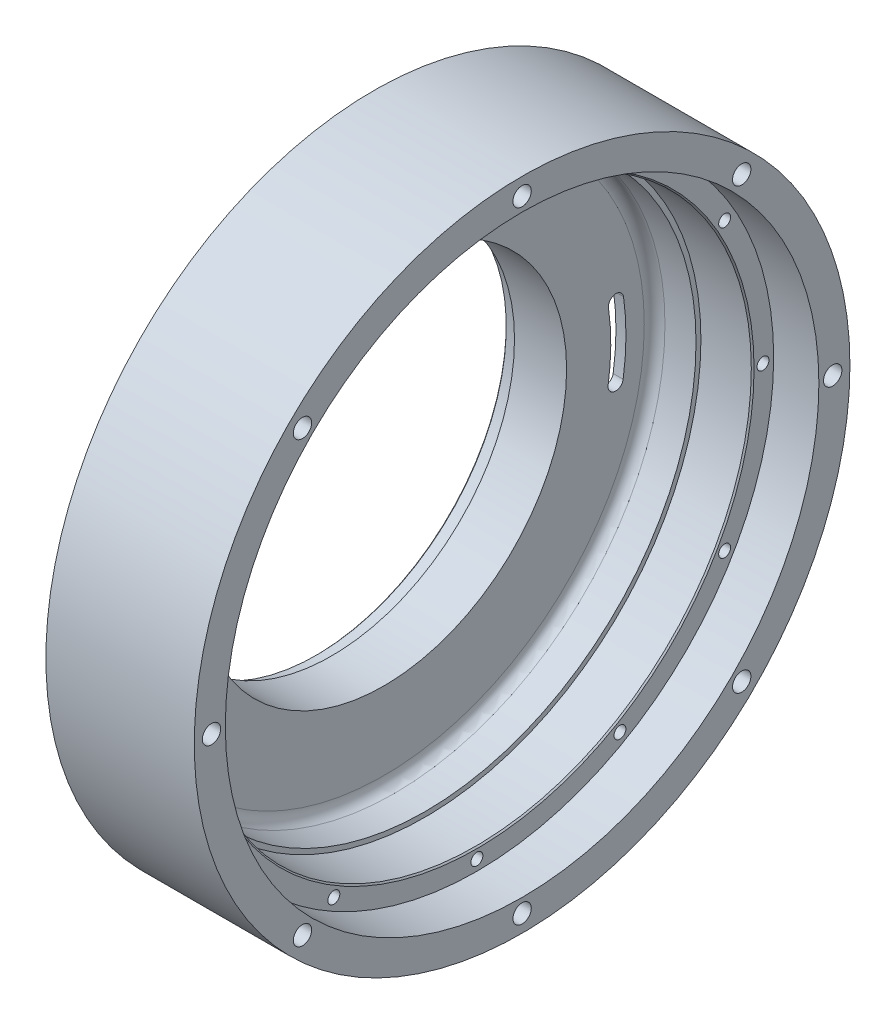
ISO-10303-21;
HEADER;
FILE_DESCRIPTION(('STEP AP214'),'2;1');
FILE_NAME('part.step','',(''),(''),'','','');
FILE_SCHEMA(('AUTOMOTIVE_DESIGN { 1 0 10303 214 1 1 1 1 }'));
ENDSEC;
DATA;
#1=APPLICATION_CONTEXT('core data for automotive mechanical design processes');
#2=APPLICATION_PROTOCOL_DEFINITION('international standard','automotive_design',2000,#1);
#3=PRODUCT_CONTEXT('',#1,'mechanical');
#4=PRODUCT('Part','Part','',(#3));
#5=PRODUCT_RELATED_PRODUCT_CATEGORY('part','',(#4));
#6=PRODUCT_DEFINITION_FORMATION('','',#4);
#7=PRODUCT_DEFINITION_CONTEXT('part definition',#1,'design');
#8=PRODUCT_DEFINITION('design','',#6,#7);
#9=PRODUCT_DEFINITION_SHAPE('','',#8);
#10=(LENGTH_UNIT() NAMED_UNIT(*) SI_UNIT(.MILLI.,.METRE.));
#11=(NAMED_UNIT(*) PLANE_ANGLE_UNIT() SI_UNIT($,.RADIAN.));
#12=(NAMED_UNIT(*) SI_UNIT($,.STERADIAN.) SOLID_ANGLE_UNIT());
#13=UNCERTAINTY_MEASURE_WITH_UNIT(LENGTH_MEASURE(1.E-05),#10,'distance_accuracy_value','');
#14=(GEOMETRIC_REPRESENTATION_CONTEXT(3) GLOBAL_UNCERTAINTY_ASSIGNED_CONTEXT((#13)) GLOBAL_UNIT_ASSIGNED_CONTEXT((#10,
#11,#12)) REPRESENTATION_CONTEXT('',''));
#15=CARTESIAN_POINT('',(0.,0.,0.));
#16=DIRECTION('',(0.,0.,1.));
#17=DIRECTION('',(1.,0.,0.));
#18=AXIS2_PLACEMENT_3D('',#15,#16,#17);
#19=CARTESIAN_POINT('',(0.,0.,0.));
#20=DIRECTION('',(1.,0.,0.));
#21=DIRECTION('',(0.,0.,-1.));
#22=AXIS2_PLACEMENT_3D('',#19,#20,#21);
#23=PLANE('',#22);
#24=CARTESIAN_POINT('',(0.,-114.3,-1.19722895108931E-12));
#25=DIRECTION('',(-1.,0.,0.));
#26=DIRECTION('',(0.,0.,1.));
#27=AXIS2_PLACEMENT_3D('',#24,#25,#26);
#28=CIRCLE('',#27,3.3782);
#29=CARTESIAN_POINT('',(0.,-114.3,3.3781999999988));
#30=VERTEX_POINT('',#29);
#31=EDGE_CURVE('E196',#30,#30,#28,.T.);
#32=ORIENTED_EDGE('',*,*,#31,.F.);
#33=EDGE_LOOP('',(#32));
#34=FACE_BOUND('',#33,.T.);
#35=CARTESIAN_POINT('',(0.,-80.8223050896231,80.8223050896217));
#36=DIRECTION('',(-1.,0.,0.));
#37=DIRECTION('',(0.,0.,1.));
#38=AXIS2_PLACEMENT_3D('',#35,#36,#37);
#39=CIRCLE('',#38,3.3782);
#40=CARTESIAN_POINT('',(0.,-80.8223050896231,84.2005050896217));
#41=VERTEX_POINT('',#40);
#42=EDGE_CURVE('E207',#41,#41,#39,.T.);
#43=ORIENTED_EDGE('',*,*,#42,.F.);
#44=EDGE_LOOP('',(#43));
#45=FACE_BOUND('',#44,.T.);
#46=CARTESIAN_POINT('',(0.,0.,114.3));
#47=DIRECTION('',(-1.,0.,0.));
#48=DIRECTION('',(0.,0.,1.));
#49=AXIS2_PLACEMENT_3D('',#46,#47,#48);
#50=CIRCLE('',#49,3.3782);
#51=CARTESIAN_POINT('',(0.,0.,117.6782));
#52=VERTEX_POINT('',#51);
#53=EDGE_CURVE('E213',#52,#52,#50,.T.);
#54=ORIENTED_EDGE('',*,*,#53,.F.);
#55=EDGE_LOOP('',(#54));
#56=FACE_BOUND('',#55,.T.);
#57=CARTESIAN_POINT('',(0.,80.822305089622,80.8223050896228));
#58=DIRECTION('',(-1.,0.,0.));
#59=DIRECTION('',(0.,0.,1.));
#60=AXIS2_PLACEMENT_3D('',#57,#58,#59);
#61=CIRCLE('',#60,3.3782);
#62=CARTESIAN_POINT('',(0.,80.822305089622,84.2005050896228));
#63=VERTEX_POINT('',#62);
#64=EDGE_CURVE('E219',#63,#63,#61,.T.);
#65=ORIENTED_EDGE('',*,*,#64,.F.);
#66=EDGE_LOOP('',(#65));
#67=FACE_BOUND('',#66,.T.);
#68=CARTESIAN_POINT('',(0.,114.3,3.9907631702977E-13));
#69=DIRECTION('',(-1.,0.,0.));
#70=DIRECTION('',(0.,0.,1.));
#71=AXIS2_PLACEMENT_3D('',#68,#69,#70);
#72=CIRCLE('',#71,3.3782);
#73=CARTESIAN_POINT('',(0.,114.3,3.3782000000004));
#74=VERTEX_POINT('',#73);
#75=EDGE_CURVE('E225',#74,#74,#72,.T.);
#76=ORIENTED_EDGE('',*,*,#75,.F.);
#77=EDGE_LOOP('',(#76));
#78=FACE_BOUND('',#77,.T.);
#79=CARTESIAN_POINT('',(0.,80.8223050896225,-80.8223050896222));
#80=DIRECTION('',(-1.,0.,0.));
#81=DIRECTION('',(0.,0.,1.));
#82=AXIS2_PLACEMENT_3D('',#79,#80,#81);
#83=CIRCLE('',#82,3.3782);
#84=CARTESIAN_POINT('',(0.,80.8223050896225,-77.4441050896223));
#85=VERTEX_POINT('',#84);
#86=EDGE_CURVE('E231',#85,#85,#83,.T.);
#87=ORIENTED_EDGE('',*,*,#86,.F.);
#88=EDGE_LOOP('',(#87));
#89=FACE_BOUND('',#88,.T.);
#90=CARTESIAN_POINT('',(0.,0.,-114.3));
#91=DIRECTION('',(-1.,0.,0.));
#92=DIRECTION('',(0.,0.,1.));
#93=AXIS2_PLACEMENT_3D('',#90,#91,#92);
#94=CIRCLE('',#93,3.3782);
#95=CARTESIAN_POINT('',(0.,0.,-110.9218));
#96=VERTEX_POINT('',#95);
#97=EDGE_CURVE('E237',#96,#96,#94,.T.);
#98=ORIENTED_EDGE('',*,*,#97,.F.);
#99=EDGE_LOOP('',(#98));
#100=FACE_BOUND('',#99,.T.);
#101=CARTESIAN_POINT('',(0.,0.,0.));
#102=DIRECTION('',(-1.,0.,0.));
#103=DIRECTION('',(0.,0.,1.));
#104=AXIS2_PLACEMENT_3D('',#101,#102,#103);
#105=CIRCLE('',#104,89.154);
#106=CARTESIAN_POINT('',(0.,12.6393227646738,-88.2535168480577));
#107=VERTEX_POINT('',#106);
#108=CARTESIAN_POINT('',(0.,-13.5824419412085,-88.1132963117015));
#109=VERTEX_POINT('',#108);
#110=EDGE_CURVE('E292',#107,#109,#105,.T.);
#111=ORIENTED_EDGE('',*,*,#110,.F.);
#112=CARTESIAN_POINT('',(0.,12.2432186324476,-85.4877371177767));
#113=DIRECTION('',(-1.,0.,0.));
#114=DIRECTION('',(0.,0.,1.));
#115=AXIS2_PLACEMENT_3D('',#112,#113,#114);
#116=CIRCLE('',#115,2.79400000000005);
#117=CARTESIAN_POINT('',(0.,11.8471145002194,-82.7219573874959));
#118=VERTEX_POINT('',#117);
#119=EDGE_CURVE('E53',#118,#107,#116,.T.);
#120=ORIENTED_EDGE('',*,*,#119,.F.);
#121=CARTESIAN_POINT('',(0.,0.,0.));
#122=DIRECTION('',(1.,0.,0.));
#123=DIRECTION('',(0.,0.,1.));
#124=AXIS2_PLACEMENT_3D('',#121,#122,#123);
#125=CIRCLE('',#124,83.566);
#126=CARTESIAN_POINT('',(0.,-12.7311207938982,-82.5905256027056));
#127=VERTEX_POINT('',#126);
#128=EDGE_CURVE('E297',#127,#118,#125,.T.);
#129=ORIENTED_EDGE('',*,*,#128,.F.);
#130=CARTESIAN_POINT('',(0.,-13.1567813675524,-85.3519109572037));
#131=DIRECTION('',(-1.,0.,0.));
#132=DIRECTION('',(0.,0.,1.));
#133=AXIS2_PLACEMENT_3D('',#130,#131,#132);
#134=CIRCLE('',#133,2.79400000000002);
#135=EDGE_CURVE('E294',#109,#127,#134,.T.);
#136=ORIENTED_EDGE('',*,*,#135,.F.);
#137=EDGE_LOOP('',(#111,#120,#129,#136));
#138=FACE_BOUND('',#137,.T.);
#139=CARTESIAN_POINT('',(0.,0.,0.));
#140=DIRECTION('',(1.,0.,0.));
#141=DIRECTION('',(0.,0.,-1.));
#142=AXIS2_PLACEMENT_3D('',#139,#140,#141);
#143=CIRCLE('',#142,76.2);
#144=CARTESIAN_POINT('',(0.,0.,-76.2));
#145=VERTEX_POINT('',#144);
#146=EDGE_CURVE('E447',#145,#145,#143,.F.);
#147=ORIENTED_EDGE('',*,*,#146,.F.);
#148=EDGE_LOOP('',(#147));
#149=FACE_BOUND('',#148,.T.);
#150=CARTESIAN_POINT('',(0.,0.,0.));
#151=DIRECTION('',(1.,0.,0.));
#152=DIRECTION('',(0.,0.,-1.));
#153=AXIS2_PLACEMENT_3D('',#150,#151,#152);
#154=CIRCLE('',#153,120.65);
#155=CARTESIAN_POINT('',(0.,0.,-120.65));
#156=VERTEX_POINT('',#155);
#157=EDGE_CURVE('E448',#156,#156,#154,.T.);
#158=ORIENTED_EDGE('',*,*,#157,.F.);
#159=EDGE_LOOP('',(#158));
#160=FACE_BOUND('',#159,.T.);
#161=CARTESIAN_POINT('',(0.,-80.8223050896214,-80.8223050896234));
#162=DIRECTION('',(-1.,0.,0.));
#163=DIRECTION('',(0.,0.,1.));
#164=AXIS2_PLACEMENT_3D('',#161,#162,#163);
#165=CIRCLE('',#164,3.3782);
#166=CARTESIAN_POINT('',(0.,-80.8223050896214,-77.4441050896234));
#167=VERTEX_POINT('',#166);
#168=EDGE_CURVE('E197',#167,#167,#165,.T.);
#169=ORIENTED_EDGE('',*,*,#168,.F.);
#170=EDGE_LOOP('',(#169));
#171=FACE_BOUND('',#170,.T.);
#172=ADVANCED_FACE('F38',(#34,#45,#56,#67,#78,#89,#100,#138,#149,#160,#171),#23,.F.);
#173=CARTESIAN_POINT('',(0.,0.,0.));
#174=DIRECTION('',(1.,0.,0.));
#175=DIRECTION('',(0.,0.,-1.));
#176=AXIS2_PLACEMENT_3D('',#173,#174,#175);
#177=CYLINDRICAL_SURFACE('',#176,67.31);
#178=CARTESIAN_POINT('',(3.68300000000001,0.,0.));
#179=DIRECTION('',(1.,0.,0.));
#180=DIRECTION('',(0.,0.,-1.));
#181=AXIS2_PLACEMENT_3D('',#178,#179,#180);
#182=CIRCLE('',#181,67.31);
#183=CARTESIAN_POINT('',(3.68300000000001,0.,-67.31));
#184=VERTEX_POINT('',#183);
#185=EDGE_CURVE('E451',#184,#184,#182,.F.);
#186=ORIENTED_EDGE('',*,*,#185,.F.);
#187=EDGE_LOOP('',(#186));
#188=FACE_BOUND('',#187,.T.);
#189=CARTESIAN_POINT('',(-15.494,0.,0.));
#190=DIRECTION('',(-1.,0.,0.));
#191=DIRECTION('',(0.,0.,1.));
#192=AXIS2_PLACEMENT_3D('',#189,#190,#191);
#193=CIRCLE('',#192,67.31);
#194=CARTESIAN_POINT('',(-15.494,0.,67.31));
#195=VERTEX_POINT('',#194);
#196=EDGE_CURVE('E358',#195,#195,#193,.F.);
#197=ORIENTED_EDGE('',*,*,#196,.F.);
#198=EDGE_LOOP('',(#197));
#199=FACE_BOUND('',#198,.T.);
#200=ADVANCED_FACE('F495',(#188,#199),#177,.F.);
#201=CARTESIAN_POINT('',(18.923,0.,0.));
#202=DIRECTION('',(1.,0.,0.));
#203=DIRECTION('',(0.,0.,-1.));
#204=AXIS2_PLACEMENT_3D('',#201,#202,#203);
#205=CYLINDRICAL_SURFACE('',#204,101.4984);
#206=CARTESIAN_POINT('',(37.465,0.,0.));
#207=DIRECTION('',(1.,0.,0.));
#208=DIRECTION('',(0.,0.,-1.));
#209=AXIS2_PLACEMENT_3D('',#206,#207,#208);
#210=CIRCLE('',#209,101.4984);
#211=CARTESIAN_POINT('',(37.465,0.,-101.4984));
#212=VERTEX_POINT('',#211);
#213=EDGE_CURVE('E11',#212,#212,#210,.T.);
#214=ORIENTED_EDGE('',*,*,#213,.T.);
#215=EDGE_LOOP('',(#214));
#216=FACE_BOUND('',#215,.T.);
#217=CARTESIAN_POINT('',(18.923,0.,0.));
#218=DIRECTION('',(1.,0.,0.));
#219=DIRECTION('',(0.,0.,-1.));
#220=AXIS2_PLACEMENT_3D('',#217,#218,#219);
#221=CIRCLE('',#220,101.4984);
#222=CARTESIAN_POINT('',(18.923,0.,-101.4984));
#223=VERTEX_POINT('',#222);
#224=EDGE_CURVE('E438',#223,#223,#221,.T.);
#225=ORIENTED_EDGE('',*,*,#224,.F.);
#226=EDGE_LOOP('',(#225));
#227=FACE_BOUND('',#226,.T.);
#228=ADVANCED_FACE('F501',(#216,#227),#205,.F.);
#229=CARTESIAN_POINT('',(3.68300000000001,0.,0.));
#230=DIRECTION('',(1.,0.,0.));
#231=DIRECTION('',(0.,0.,-1.));
#232=AXIS2_PLACEMENT_3D('',#229,#230,#231);
#233=CYLINDRICAL_SURFACE('',#232,99.695);
#234=CARTESIAN_POINT('',(7.493,0.,0.));
#235=DIRECTION('',(1.,0.,0.));
#236=DIRECTION('',(0.,0.,-1.));
#237=AXIS2_PLACEMENT_3D('',#234,#235,#236);
#238=CIRCLE('',#237,99.695);
#239=CARTESIAN_POINT('',(7.493,0.,-99.695));
#240=VERTEX_POINT('',#239);
#241=EDGE_CURVE('E471',#240,#240,#238,.F.);
#242=ORIENTED_EDGE('',*,*,#241,.T.);
#243=EDGE_LOOP('',(#242));
#244=FACE_BOUND('',#243,.T.);
#245=CARTESIAN_POINT('',(18.923,0.,0.));
#246=DIRECTION('',(1.,0.,0.));
#247=DIRECTION('',(0.,0.,-1.));
#248=AXIS2_PLACEMENT_3D('',#245,#246,#247);
#249=CIRCLE('',#248,99.695);
#250=CARTESIAN_POINT('',(18.923,0.,-99.695));
#251=VERTEX_POINT('',#250);
#252=EDGE_CURVE('E443',#251,#251,#249,.F.);
#253=ORIENTED_EDGE('',*,*,#252,.F.);
#254=EDGE_LOOP('',(#253));
#255=FACE_BOUND('',#254,.T.);
#256=ADVANCED_FACE('F512',(#244,#255),#233,.F.);
#257=CARTESIAN_POINT('',(54.61,0.,0.));
#258=DIRECTION('',(-1.,0.,0.));
#259=DIRECTION('',(0.,0.,1.));
#260=AXIS2_PLACEMENT_3D('',#257,#258,#259);
#261=CYLINDRICAL_SURFACE('',#260,120.65);
#262=CARTESIAN_POINT('',(54.61,0.,0.));
#263=DIRECTION('',(1.,0.,0.));
#264=DIRECTION('',(0.,0.,-1.));
#265=AXIS2_PLACEMENT_3D('',#262,#263,#264);
#266=CIRCLE('',#265,120.65);
#267=CARTESIAN_POINT('',(54.61,0.,-120.65));
#268=VERTEX_POINT('',#267);
#269=EDGE_CURVE('E444',#268,#268,#266,.T.);
#270=ORIENTED_EDGE('',*,*,#269,.F.);
#271=EDGE_LOOP('',(#270));
#272=FACE_BOUND('',#271,.T.);
#273=ORIENTED_EDGE('',*,*,#157,.T.);
#274=EDGE_LOOP('',(#273));
#275=FACE_BOUND('',#274,.T.);
#276=ADVANCED_FACE('F509',(#272,#275),#261,.T.);
#277=CARTESIAN_POINT('',(54.61,0.,0.));
#278=DIRECTION('',(1.,0.,0.));
#279=DIRECTION('',(0.,0.,-1.));
#280=AXIS2_PLACEMENT_3D('',#277,#278,#279);
#281=PLANE('',#280);
#282=CARTESIAN_POINT('',(54.61,-80.8223050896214,-80.8223050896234));
#283=DIRECTION('',(1.,0.,0.));
#284=DIRECTION('',(0.,0.,-1.));
#285=AXIS2_PLACEMENT_3D('',#282,#283,#284);
#286=CIRCLE('',#285,3.37819999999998);
#287=CARTESIAN_POINT('',(54.61,-80.8223050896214,-84.2005050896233));
#288=VERTEX_POINT('',#287);
#289=EDGE_CURVE('E243',#288,#288,#286,.T.);
#290=ORIENTED_EDGE('',*,*,#289,.F.);
#291=EDGE_LOOP('',(#290));
#292=FACE_BOUND('',#291,.T.);
#293=CARTESIAN_POINT('',(54.61,-114.3,-1.19722895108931E-12));
#294=DIRECTION('',(1.,0.,0.));
#295=DIRECTION('',(0.,0.,-1.));
#296=AXIS2_PLACEMENT_3D('',#293,#294,#295);
#297=CIRCLE('',#296,3.37819999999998);
#298=CARTESIAN_POINT('',(54.61,-114.3,-3.37820000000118));
#299=VERTEX_POINT('',#298);
#300=EDGE_CURVE('E249',#299,#299,#297,.T.);
#301=ORIENTED_EDGE('',*,*,#300,.F.);
#302=EDGE_LOOP('',(#301));
#303=FACE_BOUND('',#302,.T.);
#304=CARTESIAN_POINT('',(54.61,-80.8223050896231,80.8223050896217));
#305=DIRECTION('',(1.,0.,0.));
#306=DIRECTION('',(0.,0.,-1.));
#307=AXIS2_PLACEMENT_3D('',#304,#305,#306);
#308=CIRCLE('',#307,3.37819999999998);
#309=CARTESIAN_POINT('',(54.61,-80.8223050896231,77.4441050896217));
#310=VERTEX_POINT('',#309);
#311=EDGE_CURVE('E255',#310,#310,#308,.T.);
#312=ORIENTED_EDGE('',*,*,#311,.F.);
#313=EDGE_LOOP('',(#312));
#314=FACE_BOUND('',#313,.T.);
#315=CARTESIAN_POINT('',(54.61,0.,114.3));
#316=DIRECTION('',(1.,0.,0.));
#317=DIRECTION('',(0.,0.,-1.));
#318=AXIS2_PLACEMENT_3D('',#315,#316,#317);
#319=CIRCLE('',#318,3.37819999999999);
#320=CARTESIAN_POINT('',(54.61,0.,110.9218));
#321=VERTEX_POINT('',#320);
#322=EDGE_CURVE('E261',#321,#321,#319,.T.);
#323=ORIENTED_EDGE('',*,*,#322,.F.);
#324=EDGE_LOOP('',(#323));
#325=FACE_BOUND('',#324,.T.);
#326=CARTESIAN_POINT('',(54.61,80.822305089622,80.8223050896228));
#327=DIRECTION('',(1.,0.,0.));
#328=DIRECTION('',(0.,0.,-1.));
#329=AXIS2_PLACEMENT_3D('',#326,#327,#328);
#330=CIRCLE('',#329,3.37819999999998);
#331=CARTESIAN_POINT('',(54.61,80.822305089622,77.4441050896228));
#332=VERTEX_POINT('',#331);
#333=EDGE_CURVE('E267',#332,#332,#330,.T.);
#334=ORIENTED_EDGE('',*,*,#333,.F.);
#335=EDGE_LOOP('',(#334));
#336=FACE_BOUND('',#335,.T.);
#337=CARTESIAN_POINT('',(54.61,114.3,3.9907631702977E-13));
#338=DIRECTION('',(1.,0.,0.));
#339=DIRECTION('',(0.,0.,-1.));
#340=AXIS2_PLACEMENT_3D('',#337,#338,#339);
#341=CIRCLE('',#340,3.37819999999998);
#342=CARTESIAN_POINT('',(54.61,114.3,-3.37819999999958));
#343=VERTEX_POINT('',#342);
#344=EDGE_CURVE('E273',#343,#343,#341,.T.);
#345=ORIENTED_EDGE('',*,*,#344,.F.);
#346=EDGE_LOOP('',(#345));
#347=FACE_BOUND('',#346,.T.);
#348=CARTESIAN_POINT('',(54.61,80.8223050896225,-80.8223050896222));
#349=DIRECTION('',(1.,0.,0.));
#350=DIRECTION('',(0.,0.,-1.));
#351=AXIS2_PLACEMENT_3D('',#348,#349,#350);
#352=CIRCLE('',#351,3.37819999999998);
#353=CARTESIAN_POINT('',(54.61,80.8223050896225,-84.2005050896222));
#354=VERTEX_POINT('',#353);
#355=EDGE_CURVE('E279',#354,#354,#352,.T.);
#356=ORIENTED_EDGE('',*,*,#355,.F.);
#357=EDGE_LOOP('',(#356));
#358=FACE_BOUND('',#357,.T.);
#359=CARTESIAN_POINT('',(54.61,0.,-114.3));
#360=DIRECTION('',(1.,0.,0.));
#361=DIRECTION('',(0.,0.,-1.));
#362=AXIS2_PLACEMENT_3D('',#359,#360,#361);
#363=CIRCLE('',#362,3.37819999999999);
#364=CARTESIAN_POINT('',(54.61,0.,-117.6782));
#365=VERTEX_POINT('',#364);
#366=EDGE_CURVE('E285',#365,#365,#363,.T.);
#367=ORIENTED_EDGE('',*,*,#366,.F.);
#368=EDGE_LOOP('',(#367));
#369=FACE_BOUND('',#368,.T.);
#370=CARTESIAN_POINT('',(54.61,0.,0.));
#371=DIRECTION('',(1.,0.,0.));
#372=DIRECTION('',(0.,0.,-1.));
#373=AXIS2_PLACEMENT_3D('',#370,#371,#372);
#374=CIRCLE('',#373,109.22);
#375=CARTESIAN_POINT('',(54.61,0.,-109.22));
#376=VERTEX_POINT('',#375);
#377=EDGE_CURVE('E434',#376,#376,#374,.T.);
#378=ORIENTED_EDGE('',*,*,#377,.F.);
#379=EDGE_LOOP('',(#378));
#380=FACE_BOUND('',#379,.T.);
#381=ORIENTED_EDGE('',*,*,#269,.T.);
#382=EDGE_LOOP('',(#381));
#383=FACE_BOUND('',#382,.T.);
#384=ADVANCED_FACE('F508',(#292,#303,#314,#325,#336,#347,#358,#369,#380,#383),#281,.T.);
#385=CARTESIAN_POINT('',(3.68300000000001,0.,0.));
#386=DIRECTION('',(1.,0.,0.));
#387=DIRECTION('',(0.,0.,-1.));
#388=AXIS2_PLACEMENT_3D('',#385,#386,#387);
#389=PLANE('',#388);
#390=CARTESIAN_POINT('',(3.68300000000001,0.,0.));
#391=DIRECTION('',(1.,0.,0.));
#392=DIRECTION('',(0.,0.,-1.));
#393=AXIS2_PLACEMENT_3D('',#390,#391,#392);
#394=CIRCLE('',#393,95.885);
#395=CARTESIAN_POINT('',(3.68300000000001,0.,-95.885));
#396=VERTEX_POINT('',#395);
#397=EDGE_CURVE('E468',#396,#396,#394,.T.);
#398=ORIENTED_EDGE('',*,*,#397,.T.);
#399=EDGE_LOOP('',(#398));
#400=FACE_BOUND('',#399,.T.);
#401=CARTESIAN_POINT('',(3.68300000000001,12.2432186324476,-85.4877371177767));
#402=DIRECTION('',(1.,0.,0.));
#403=DIRECTION('',(0.,0.,-1.));
#404=AXIS2_PLACEMENT_3D('',#401,#402,#403);
#405=CIRCLE('',#404,2.79400000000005);
#406=CARTESIAN_POINT('',(3.68300000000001,12.6393227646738,-88.2535168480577));
#407=VERTEX_POINT('',#406);
#408=CARTESIAN_POINT('',(3.68300000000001,11.8471145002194,-82.7219573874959));
#409=VERTEX_POINT('',#408);
#410=EDGE_CURVE('E466',#407,#409,#405,.T.);
#411=ORIENTED_EDGE('',*,*,#410,.F.);
#412=CARTESIAN_POINT('',(3.68300000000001,0.,0.));
#413=DIRECTION('',(1.,0.,0.));
#414=DIRECTION('',(0.,0.,-1.));
#415=AXIS2_PLACEMENT_3D('',#412,#413,#414);
#416=CIRCLE('',#415,89.154);
#417=CARTESIAN_POINT('',(3.68300000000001,-13.5824419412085,-88.1132963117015));
#418=VERTEX_POINT('',#417);
#419=EDGE_CURVE('E458',#418,#407,#416,.T.);
#420=ORIENTED_EDGE('',*,*,#419,.F.);
#421=CARTESIAN_POINT('',(3.68300000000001,-13.1567813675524,-85.3519109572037));
#422=DIRECTION('',(1.,0.,0.));
#423=DIRECTION('',(0.,0.,-1.));
#424=AXIS2_PLACEMENT_3D('',#421,#422,#423);
#425=CIRCLE('',#424,2.79400000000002);
#426=CARTESIAN_POINT('',(3.68300000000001,-12.7311207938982,-82.5905256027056));
#427=VERTEX_POINT('',#426);
#428=EDGE_CURVE('E462',#427,#418,#425,.T.);
#429=ORIENTED_EDGE('',*,*,#428,.F.);
#430=CARTESIAN_POINT('',(3.68300000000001,0.,0.));
#431=DIRECTION('',(1.,0.,0.));
#432=DIRECTION('',(0.,0.,-1.));
#433=AXIS2_PLACEMENT_3D('',#430,#431,#432);
#434=CIRCLE('',#433,83.566);
#435=EDGE_CURVE('E464',#409,#427,#434,.F.);
#436=ORIENTED_EDGE('',*,*,#435,.F.);
#437=EDGE_LOOP('',(#411,#420,#429,#436));
#438=FACE_BOUND('',#437,.T.);
#439=ORIENTED_EDGE('',*,*,#185,.T.);
#440=EDGE_LOOP('',(#439));
#441=FACE_BOUND('',#440,.T.);
#442=ADVANCED_FACE('F524',(#400,#438,#441),#389,.T.);
#443=CARTESIAN_POINT('',(18.923,0.,0.));
#444=DIRECTION('',(1.,0.,0.));
#445=DIRECTION('',(0.,0.,-1.));
#446=AXIS2_PLACEMENT_3D('',#443,#444,#445);
#447=PLANE('',#446);
#448=ORIENTED_EDGE('',*,*,#224,.T.);
#449=EDGE_LOOP('',(#448));
#450=FACE_BOUND('',#449,.T.);
#451=ORIENTED_EDGE('',*,*,#252,.T.);
#452=EDGE_LOOP('',(#451));
#453=FACE_BOUND('',#452,.T.);
#454=ADVANCED_FACE('F527',(#450,#453),#447,.T.);
#455=CARTESIAN_POINT('',(37.973,0.,0.));
#456=DIRECTION('',(1.,0.,0.));
#457=DIRECTION('',(0.,0.,-1.));
#458=AXIS2_PLACEMENT_3D('',#455,#456,#457);
#459=PLANE('',#458);
#460=CARTESIAN_POINT('',(37.973,0.,0.));
#461=DIRECTION('',(1.,0.,0.));
#462=DIRECTION('',(0.,0.,-1.));
#463=AXIS2_PLACEMENT_3D('',#460,#461,#462);
#464=CIRCLE('',#463,102.0064);
#465=CARTESIAN_POINT('',(37.973,0.,-102.0064));
#466=VERTEX_POINT('',#465);
#467=EDGE_CURVE('E46',#466,#466,#464,.F.);
#468=ORIENTED_EDGE('',*,*,#467,.T.);
#469=EDGE_LOOP('',(#468));
#470=FACE_BOUND('',#469,.T.);
#471=CARTESIAN_POINT('',(37.973,91.1777525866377,-52.6414999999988));
#472=DIRECTION('',(1.,0.,0.));
#473=DIRECTION('',(0.,0.,-1.));
#474=AXIS2_PLACEMENT_3D('',#471,#472,#473);
#475=CIRCLE('',#474,2.19709999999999);
#476=CARTESIAN_POINT('',(37.973,91.1777525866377,-54.8385999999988));
#477=VERTEX_POINT('',#476);
#478=EDGE_CURVE('E362',#477,#477,#475,.T.);
#479=ORIENTED_EDGE('',*,*,#478,.F.);
#480=EDGE_LOOP('',(#479));
#481=FACE_BOUND('',#480,.T.);
#482=CARTESIAN_POINT('',(37.973,52.6415000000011,-91.1777525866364));
#483=DIRECTION('',(1.,0.,0.));
#484=DIRECTION('',(0.,0.,-1.));
#485=AXIS2_PLACEMENT_3D('',#482,#483,#484);
#486=CIRCLE('',#485,2.1971);
#487=CARTESIAN_POINT('',(37.973,52.6415000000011,-93.3748525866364));
#488=VERTEX_POINT('',#487);
#489=EDGE_CURVE('E368',#488,#488,#486,.T.);
#490=ORIENTED_EDGE('',*,*,#489,.F.);
#491=EDGE_LOOP('',(#490));
#492=FACE_BOUND('',#491,.T.);
#493=CARTESIAN_POINT('',(37.973,1.10278088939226E-12,-105.283));
#494=DIRECTION('',(1.,0.,0.));
#495=DIRECTION('',(0.,0.,-1.));
#496=AXIS2_PLACEMENT_3D('',#493,#494,#495);
#497=CIRCLE('',#496,2.1971);
#498=CARTESIAN_POINT('',(37.973,1.10278088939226E-12,-107.4801));
#499=VERTEX_POINT('',#498);
#500=EDGE_CURVE('E374',#499,#499,#497,.T.);
#501=ORIENTED_EDGE('',*,*,#500,.F.);
#502=EDGE_LOOP('',(#501));
#503=FACE_BOUND('',#502,.T.);
#504=CARTESIAN_POINT('',(37.973,-52.6414999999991,-91.1777525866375));
#505=DIRECTION('',(1.,0.,0.));
#506=DIRECTION('',(0.,0.,-1.));
#507=AXIS2_PLACEMENT_3D('',#504,#505,#506);
#508=CIRCLE('',#507,2.1971);
#509=CARTESIAN_POINT('',(37.973,-52.6414999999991,-93.3748525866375));
#510=VERTEX_POINT('',#509);
#511=EDGE_CURVE('E380',#510,#510,#508,.T.);
#512=ORIENTED_EDGE('',*,*,#511,.F.);
#513=EDGE_LOOP('',(#512));
#514=FACE_BOUND('',#513,.T.);
#515=CARTESIAN_POINT('',(37.973,-91.1777525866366,-52.6415000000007));
#516=DIRECTION('',(1.,0.,0.));
#517=DIRECTION('',(0.,0.,-1.));
#518=AXIS2_PLACEMENT_3D('',#515,#516,#517);
#519=CIRCLE('',#518,2.19709999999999);
#520=CARTESIAN_POINT('',(37.973,-91.1777525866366,-54.8386000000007));
#521=VERTEX_POINT('',#520);
#522=EDGE_CURVE('E386',#521,#521,#519,.T.);
#523=ORIENTED_EDGE('',*,*,#522,.F.);
#524=EDGE_LOOP('',(#523));
#525=FACE_BOUND('',#524,.T.);
#526=CARTESIAN_POINT('',(37.973,-105.283,0.));
#527=DIRECTION('',(1.,0.,0.));
#528=DIRECTION('',(0.,0.,-1.));
#529=AXIS2_PLACEMENT_3D('',#526,#527,#528);
#530=CIRCLE('',#529,2.19709999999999);
#531=CARTESIAN_POINT('',(37.973,-105.283,-2.19709999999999));
#532=VERTEX_POINT('',#531);
#533=EDGE_CURVE('E392',#532,#532,#530,.T.);
#534=ORIENTED_EDGE('',*,*,#533,.F.);
#535=EDGE_LOOP('',(#534));
#536=FACE_BOUND('',#535,.T.);
#537=CARTESIAN_POINT('',(37.973,-91.1777525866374,52.6414999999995));
#538=DIRECTION('',(1.,0.,0.));
#539=DIRECTION('',(0.,0.,-1.));
#540=AXIS2_PLACEMENT_3D('',#537,#538,#539);
#541=CIRCLE('',#540,2.19709999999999);
#542=CARTESIAN_POINT('',(37.973,-91.1777525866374,50.4443999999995));
#543=VERTEX_POINT('',#542);
#544=EDGE_CURVE('E398',#543,#543,#541,.T.);
#545=ORIENTED_EDGE('',*,*,#544,.F.);
#546=EDGE_LOOP('',(#545));
#547=FACE_BOUND('',#546,.T.);
#548=CARTESIAN_POINT('',(37.973,-52.6415000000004,91.1777525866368));
#549=DIRECTION('',(1.,0.,0.));
#550=DIRECTION('',(0.,0.,-1.));
#551=AXIS2_PLACEMENT_3D('',#548,#549,#550);
#552=CIRCLE('',#551,2.1971);
#553=CARTESIAN_POINT('',(37.973,-52.6415000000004,88.9806525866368));
#554=VERTEX_POINT('',#553);
#555=EDGE_CURVE('E404',#554,#554,#552,.T.);
#556=ORIENTED_EDGE('',*,*,#555,.F.);
#557=EDGE_LOOP('',(#556));
#558=FACE_BOUND('',#557,.T.);
#559=CARTESIAN_POINT('',(37.973,-3.67593629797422E-13,105.283));
#560=DIRECTION('',(1.,0.,0.));
#561=DIRECTION('',(0.,0.,-1.));
#562=AXIS2_PLACEMENT_3D('',#559,#560,#561);
#563=CIRCLE('',#562,2.1971);
#564=CARTESIAN_POINT('',(37.973,-3.67593629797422E-13,103.0859));
#565=VERTEX_POINT('',#564);
#566=EDGE_CURVE('E410',#565,#565,#563,.T.);
#567=ORIENTED_EDGE('',*,*,#566,.F.);
#568=EDGE_LOOP('',(#567));
#569=FACE_BOUND('',#568,.T.);
#570=CARTESIAN_POINT('',(37.973,52.6414999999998,91.1777525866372));
#571=DIRECTION('',(1.,0.,0.));
#572=DIRECTION('',(0.,0.,-1.));
#573=AXIS2_PLACEMENT_3D('',#570,#571,#572);
#574=CIRCLE('',#573,2.1971);
#575=CARTESIAN_POINT('',(37.973,52.6414999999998,88.9806525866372));
#576=VERTEX_POINT('',#575);
#577=EDGE_CURVE('E416',#576,#576,#574,.T.);
#578=ORIENTED_EDGE('',*,*,#577,.F.);
#579=EDGE_LOOP('',(#578));
#580=FACE_BOUND('',#579,.T.);
#581=CARTESIAN_POINT('',(37.973,91.177752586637,52.6415000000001));
#582=DIRECTION('',(1.,0.,0.));
#583=DIRECTION('',(0.,0.,-1.));
#584=AXIS2_PLACEMENT_3D('',#581,#582,#583);
#585=CIRCLE('',#584,2.19709999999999);
#586=CARTESIAN_POINT('',(37.973,91.177752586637,50.4444000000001));
#587=VERTEX_POINT('',#586);
#588=EDGE_CURVE('E422',#587,#587,#585,.T.);
#589=ORIENTED_EDGE('',*,*,#588,.F.);
#590=EDGE_LOOP('',(#589));
#591=FACE_BOUND('',#590,.T.);
#592=CARTESIAN_POINT('',(37.973,105.283,0.));
#593=DIRECTION('',(1.,0.,0.));
#594=DIRECTION('',(0.,0.,-1.));
#595=AXIS2_PLACEMENT_3D('',#592,#593,#594);
#596=CIRCLE('',#595,2.19709999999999);
#597=CARTESIAN_POINT('',(37.973,105.283,-2.19709999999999));
#598=VERTEX_POINT('',#597);
#599=EDGE_CURVE('E428',#598,#598,#596,.T.);
#600=ORIENTED_EDGE('',*,*,#599,.F.);
#601=EDGE_LOOP('',(#600));
#602=FACE_BOUND('',#601,.T.);
#603=CARTESIAN_POINT('',(37.973,0.,0.));
#604=DIRECTION('',(1.,0.,0.));
#605=DIRECTION('',(0.,0.,-1.));
#606=AXIS2_PLACEMENT_3D('',#603,#604,#605);
#607=CIRCLE('',#606,109.22);
#608=CARTESIAN_POINT('',(37.973,0.,-109.22));
#609=VERTEX_POINT('',#608);
#610=EDGE_CURVE('E435',#609,#609,#607,.T.);
#611=ORIENTED_EDGE('',*,*,#610,.T.);
#612=EDGE_LOOP('',(#611));
#613=FACE_BOUND('',#612,.T.);
#614=ADVANCED_FACE('F482',(#470,#481,#492,#503,#514,#525,#536,#547,#558,#569,#580,#591,#602,
#613),#459,.T.);
#615=CARTESIAN_POINT('',(37.973,0.,0.));
#616=DIRECTION('',(1.,0.,0.));
#617=DIRECTION('',(0.,0.,-1.));
#618=AXIS2_PLACEMENT_3D('',#615,#616,#617);
#619=CYLINDRICAL_SURFACE('',#618,109.22);
#620=ORIENTED_EDGE('',*,*,#610,.F.);
#621=EDGE_LOOP('',(#620));
#622=FACE_BOUND('',#621,.T.);
#623=ORIENTED_EDGE('',*,*,#377,.T.);
#624=EDGE_LOOP('',(#623));
#625=FACE_BOUND('',#624,.T.);
#626=ADVANCED_FACE('F654',(#622,#625),#619,.F.);
#627=CARTESIAN_POINT('',(22.4536,105.283,0.));
#628=DIRECTION('',(1.,0.,0.));
#629=DIRECTION('',(0.,0.,-1.));
#630=AXIS2_PLACEMENT_3D('',#627,#628,#629);
#631=CONICAL_SURFACE('',#630,2.19709999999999,1.02974425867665);
#632=CARTESIAN_POINT('',(21.1334491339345,105.283,0.));
#633=VERTEX_POINT('',#632);
#634=VERTEX_LOOP('',#633);
#635=FACE_BOUND('',#634,.T.);
#636=CARTESIAN_POINT('',(22.4536,105.283,0.));
#637=DIRECTION('',(1.,0.,0.));
#638=DIRECTION('',(0.,0.,-1.));
#639=AXIS2_PLACEMENT_3D('',#636,#637,#638);
#640=CIRCLE('',#639,2.19709999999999);
#641=CARTESIAN_POINT('',(22.4536,105.283,-2.19709999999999));
#642=VERTEX_POINT('',#641);
#643=EDGE_CURVE('E431',#642,#642,#640,.T.);
#644=ORIENTED_EDGE('',*,*,#643,.T.);
#645=EDGE_LOOP('',(#644));
#646=FACE_BOUND('',#645,.T.);
#647=ADVANCED_FACE('F650',(#635,#646),#631,.F.);
#648=CARTESIAN_POINT('',(37.973,105.283,0.));
#649=DIRECTION('',(1.,0.,0.));
#650=DIRECTION('',(0.,0.,-1.));
#651=AXIS2_PLACEMENT_3D('',#648,#649,#650);
#652=CYLINDRICAL_SURFACE('',#651,2.19709999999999);
#653=ORIENTED_EDGE('',*,*,#643,.F.);
#654=EDGE_LOOP('',(#653));
#655=FACE_BOUND('',#654,.T.);
#656=ORIENTED_EDGE('',*,*,#599,.T.);
#657=EDGE_LOOP('',(#656));
#658=FACE_BOUND('',#657,.T.);
#659=ADVANCED_FACE('F646',(#655,#658),#652,.F.);
#660=CARTESIAN_POINT('',(22.4536,91.177752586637,52.6415000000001));
#661=DIRECTION('',(1.,0.,0.));
#662=DIRECTION('',(0.,0.,-1.));
#663=AXIS2_PLACEMENT_3D('',#660,#661,#662);
#664=CONICAL_SURFACE('',#663,2.19709999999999,1.02974425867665);
#665=CARTESIAN_POINT('',(21.1334491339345,91.177752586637,52.6415000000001));
#666=VERTEX_POINT('',#665);
#667=VERTEX_LOOP('',#666);
#668=FACE_BOUND('',#667,.T.);
#669=CARTESIAN_POINT('',(22.4536,91.177752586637,52.6415000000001));
#670=DIRECTION('',(1.,0.,0.));
#671=DIRECTION('',(0.,0.,-1.));
#672=AXIS2_PLACEMENT_3D('',#669,#670,#671);
#673=CIRCLE('',#672,2.19709999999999);
#674=CARTESIAN_POINT('',(22.4536,91.177752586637,50.4444000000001));
#675=VERTEX_POINT('',#674);
#676=EDGE_CURVE('E425',#675,#675,#673,.T.);
#677=ORIENTED_EDGE('',*,*,#676,.T.);
#678=EDGE_LOOP('',(#677));
#679=FACE_BOUND('',#678,.T.);
#680=ADVANCED_FACE('F642',(#668,#679),#664,.F.);
#681=CARTESIAN_POINT('',(37.973,91.177752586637,52.6415000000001));
#682=DIRECTION('',(1.,0.,0.));
#683=DIRECTION('',(0.,0.,-1.));
#684=AXIS2_PLACEMENT_3D('',#681,#682,#683);
#685=CYLINDRICAL_SURFACE('',#684,2.19709999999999);
#686=ORIENTED_EDGE('',*,*,#676,.F.);
#687=EDGE_LOOP('',(#686));
#688=FACE_BOUND('',#687,.T.);
#689=ORIENTED_EDGE('',*,*,#588,.T.);
#690=EDGE_LOOP('',(#689));
#691=FACE_BOUND('',#690,.T.);
#692=ADVANCED_FACE('F638',(#688,#691),#685,.F.);
#693=CARTESIAN_POINT('',(22.4536,52.6414999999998,91.1777525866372));
#694=DIRECTION('',(1.,0.,0.));
#695=DIRECTION('',(0.,0.,-1.));
#696=AXIS2_PLACEMENT_3D('',#693,#694,#695);
#697=CONICAL_SURFACE('',#696,2.19709999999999,1.02974425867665);
#698=CARTESIAN_POINT('',(21.1334491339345,52.6414999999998,91.1777525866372));
#699=VERTEX_POINT('',#698);
#700=VERTEX_LOOP('',#699);
#701=FACE_BOUND('',#700,.T.);
#702=CARTESIAN_POINT('',(22.4536,52.6414999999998,91.1777525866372));
#703=DIRECTION('',(1.,0.,0.));
#704=DIRECTION('',(0.,0.,-1.));
#705=AXIS2_PLACEMENT_3D('',#702,#703,#704);
#706=CIRCLE('',#705,2.19709999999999);
#707=CARTESIAN_POINT('',(22.4536,52.6414999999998,88.9806525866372));
#708=VERTEX_POINT('',#707);
#709=EDGE_CURVE('E419',#708,#708,#706,.T.);
#710=ORIENTED_EDGE('',*,*,#709,.T.);
#711=EDGE_LOOP('',(#710));
#712=FACE_BOUND('',#711,.T.);
#713=ADVANCED_FACE('F634',(#701,#712),#697,.F.);
#714=CARTESIAN_POINT('',(37.973,52.6414999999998,91.1777525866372));
#715=DIRECTION('',(1.,0.,0.));
#716=DIRECTION('',(0.,0.,-1.));
#717=AXIS2_PLACEMENT_3D('',#714,#715,#716);
#718=CYLINDRICAL_SURFACE('',#717,2.1971);
#719=ORIENTED_EDGE('',*,*,#709,.F.);
#720=EDGE_LOOP('',(#719));
#721=FACE_BOUND('',#720,.T.);
#722=ORIENTED_EDGE('',*,*,#577,.T.);
#723=EDGE_LOOP('',(#722));
#724=FACE_BOUND('',#723,.T.);
#725=ADVANCED_FACE('F630',(#721,#724),#718,.F.);
#726=CARTESIAN_POINT('',(22.4536,-3.67593629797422E-13,105.283));
#727=DIRECTION('',(1.,0.,0.));
#728=DIRECTION('',(0.,0.,-1.));
#729=AXIS2_PLACEMENT_3D('',#726,#727,#728);
#730=CONICAL_SURFACE('',#729,2.1971,1.02974425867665);
#731=CARTESIAN_POINT('',(21.1334491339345,-3.71723594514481E-13,105.283));
#732=VERTEX_POINT('',#731);
#733=VERTEX_LOOP('',#732);
#734=FACE_BOUND('',#733,.T.);
#735=CARTESIAN_POINT('',(22.4536,-3.67593629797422E-13,105.283));
#736=DIRECTION('',(1.,0.,0.));
#737=DIRECTION('',(0.,0.,-1.));
#738=AXIS2_PLACEMENT_3D('',#735,#736,#737);
#739=CIRCLE('',#738,2.1971);
#740=CARTESIAN_POINT('',(22.4536,-3.67593629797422E-13,103.0859));
#741=VERTEX_POINT('',#740);
#742=EDGE_CURVE('E413',#741,#741,#739,.T.);
#743=ORIENTED_EDGE('',*,*,#742,.T.);
#744=EDGE_LOOP('',(#743));
#745=FACE_BOUND('',#744,.T.);
#746=ADVANCED_FACE('F626',(#734,#745),#730,.F.);
#747=CARTESIAN_POINT('',(37.973,-3.67593629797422E-13,105.283));
#748=DIRECTION('',(1.,0.,0.));
#749=DIRECTION('',(0.,0.,-1.));
#750=AXIS2_PLACEMENT_3D('',#747,#748,#749);
#751=CYLINDRICAL_SURFACE('',#750,2.1971);
#752=ORIENTED_EDGE('',*,*,#742,.F.);
#753=EDGE_LOOP('',(#752));
#754=FACE_BOUND('',#753,.T.);
#755=ORIENTED_EDGE('',*,*,#566,.T.);
#756=EDGE_LOOP('',(#755));
#757=FACE_BOUND('',#756,.T.);
#758=ADVANCED_FACE('F622',(#754,#757),#751,.F.);
#759=CARTESIAN_POINT('',(22.4536,-52.6415000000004,91.1777525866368));
#760=DIRECTION('',(1.,0.,0.));
#761=DIRECTION('',(0.,0.,-1.));
#762=AXIS2_PLACEMENT_3D('',#759,#760,#761);
#763=CONICAL_SURFACE('',#762,2.19709999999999,1.02974425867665);
#764=CARTESIAN_POINT('',(21.1334491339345,-52.6415000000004,91.1777525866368));
#765=VERTEX_POINT('',#764);
#766=VERTEX_LOOP('',#765);
#767=FACE_BOUND('',#766,.T.);
#768=CARTESIAN_POINT('',(22.4536,-52.6415000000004,91.1777525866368));
#769=DIRECTION('',(1.,0.,0.));
#770=DIRECTION('',(0.,0.,-1.));
#771=AXIS2_PLACEMENT_3D('',#768,#769,#770);
#772=CIRCLE('',#771,2.19709999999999);
#773=CARTESIAN_POINT('',(22.4536,-52.6415000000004,88.9806525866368));
#774=VERTEX_POINT('',#773);
#775=EDGE_CURVE('E407',#774,#774,#772,.T.);
#776=ORIENTED_EDGE('',*,*,#775,.T.);
#777=EDGE_LOOP('',(#776));
#778=FACE_BOUND('',#777,.T.);
#779=ADVANCED_FACE('F618',(#767,#778),#763,.F.);
#780=CARTESIAN_POINT('',(37.973,-52.6415000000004,91.1777525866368));
#781=DIRECTION('',(1.,0.,0.));
#782=DIRECTION('',(0.,0.,-1.));
#783=AXIS2_PLACEMENT_3D('',#780,#781,#782);
#784=CYLINDRICAL_SURFACE('',#783,2.1971);
#785=ORIENTED_EDGE('',*,*,#775,.F.);
#786=EDGE_LOOP('',(#785));
#787=FACE_BOUND('',#786,.T.);
#788=ORIENTED_EDGE('',*,*,#555,.T.);
#789=EDGE_LOOP('',(#788));
#790=FACE_BOUND('',#789,.T.);
#791=ADVANCED_FACE('F614',(#787,#790),#784,.F.);
#792=CARTESIAN_POINT('',(22.4536,-91.1777525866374,52.6414999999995));
#793=DIRECTION('',(1.,0.,0.));
#794=DIRECTION('',(0.,0.,-1.));
#795=AXIS2_PLACEMENT_3D('',#792,#793,#794);
#796=CONICAL_SURFACE('',#795,2.19709999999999,1.02974425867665);
#797=CARTESIAN_POINT('',(21.1334491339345,-91.1777525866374,52.6414999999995));
#798=VERTEX_POINT('',#797);
#799=VERTEX_LOOP('',#798);
#800=FACE_BOUND('',#799,.T.);
#801=CARTESIAN_POINT('',(22.4536,-91.1777525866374,52.6414999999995));
#802=DIRECTION('',(1.,0.,0.));
#803=DIRECTION('',(0.,0.,-1.));
#804=AXIS2_PLACEMENT_3D('',#801,#802,#803);
#805=CIRCLE('',#804,2.19709999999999);
#806=CARTESIAN_POINT('',(22.4536,-91.1777525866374,50.4443999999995));
#807=VERTEX_POINT('',#806);
#808=EDGE_CURVE('E401',#807,#807,#805,.T.);
#809=ORIENTED_EDGE('',*,*,#808,.T.);
#810=EDGE_LOOP('',(#809));
#811=FACE_BOUND('',#810,.T.);
#812=ADVANCED_FACE('F610',(#800,#811),#796,.F.);
#813=CARTESIAN_POINT('',(37.973,-91.1777525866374,52.6414999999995));
#814=DIRECTION('',(1.,0.,0.));
#815=DIRECTION('',(0.,0.,-1.));
#816=AXIS2_PLACEMENT_3D('',#813,#814,#815);
#817=CYLINDRICAL_SURFACE('',#816,2.19709999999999);
#818=ORIENTED_EDGE('',*,*,#808,.F.);
#819=EDGE_LOOP('',(#818));
#820=FACE_BOUND('',#819,.T.);
#821=ORIENTED_EDGE('',*,*,#544,.T.);
#822=EDGE_LOOP('',(#821));
#823=FACE_BOUND('',#822,.T.);
#824=ADVANCED_FACE('F606',(#820,#823),#817,.F.);
#825=CARTESIAN_POINT('',(22.4536,-105.283,0.));
#826=DIRECTION('',(1.,0.,0.));
#827=DIRECTION('',(0.,0.,-1.));
#828=AXIS2_PLACEMENT_3D('',#825,#826,#827);
#829=CONICAL_SURFACE('',#828,2.19709999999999,1.02974425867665);
#830=CARTESIAN_POINT('',(21.1334491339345,-105.283,0.));
#831=VERTEX_POINT('',#830);
#832=VERTEX_LOOP('',#831);
#833=FACE_BOUND('',#832,.T.);
#834=CARTESIAN_POINT('',(22.4536,-105.283,0.));
#835=DIRECTION('',(1.,0.,0.));
#836=DIRECTION('',(0.,0.,-1.));
#837=AXIS2_PLACEMENT_3D('',#834,#835,#836);
#838=CIRCLE('',#837,2.19709999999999);
#839=CARTESIAN_POINT('',(22.4536,-105.283,-2.19709999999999));
#840=VERTEX_POINT('',#839);
#841=EDGE_CURVE('E395',#840,#840,#838,.T.);
#842=ORIENTED_EDGE('',*,*,#841,.T.);
#843=EDGE_LOOP('',(#842));
#844=FACE_BOUND('',#843,.T.);
#845=ADVANCED_FACE('F602',(#833,#844),#829,.F.);
#846=CARTESIAN_POINT('',(37.973,-105.283,0.));
#847=DIRECTION('',(1.,0.,0.));
#848=DIRECTION('',(0.,0.,-1.));
#849=AXIS2_PLACEMENT_3D('',#846,#847,#848);
#850=CYLINDRICAL_SURFACE('',#849,2.19709999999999);
#851=ORIENTED_EDGE('',*,*,#841,.F.);
#852=EDGE_LOOP('',(#851));
#853=FACE_BOUND('',#852,.T.);
#854=ORIENTED_EDGE('',*,*,#533,.T.);
#855=EDGE_LOOP('',(#854));
#856=FACE_BOUND('',#855,.T.);
#857=ADVANCED_FACE('F598',(#853,#856),#850,.F.);
#858=CARTESIAN_POINT('',(22.4536,-91.1777525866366,-52.6415000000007));
#859=DIRECTION('',(1.,0.,0.));
#860=DIRECTION('',(0.,0.,-1.));
#861=AXIS2_PLACEMENT_3D('',#858,#859,#860);
#862=CONICAL_SURFACE('',#861,2.19709999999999,1.02974425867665);
#863=CARTESIAN_POINT('',(21.1334491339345,-91.1777525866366,-52.6415000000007));
#864=VERTEX_POINT('',#863);
#865=VERTEX_LOOP('',#864);
#866=FACE_BOUND('',#865,.T.);
#867=CARTESIAN_POINT('',(22.4536,-91.1777525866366,-52.6415000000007));
#868=DIRECTION('',(1.,0.,0.));
#869=DIRECTION('',(0.,0.,-1.));
#870=AXIS2_PLACEMENT_3D('',#867,#868,#869);
#871=CIRCLE('',#870,2.19709999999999);
#872=CARTESIAN_POINT('',(22.4536,-91.1777525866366,-54.8386000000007));
#873=VERTEX_POINT('',#872);
#874=EDGE_CURVE('E389',#873,#873,#871,.T.);
#875=ORIENTED_EDGE('',*,*,#874,.T.);
#876=EDGE_LOOP('',(#875));
#877=FACE_BOUND('',#876,.T.);
#878=ADVANCED_FACE('F594',(#866,#877),#862,.F.);
#879=CARTESIAN_POINT('',(37.973,-91.1777525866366,-52.6415000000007));
#880=DIRECTION('',(1.,0.,0.));
#881=DIRECTION('',(0.,0.,-1.));
#882=AXIS2_PLACEMENT_3D('',#879,#880,#881);
#883=CYLINDRICAL_SURFACE('',#882,2.19709999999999);
#884=ORIENTED_EDGE('',*,*,#874,.F.);
#885=EDGE_LOOP('',(#884));
#886=FACE_BOUND('',#885,.T.);
#887=ORIENTED_EDGE('',*,*,#522,.T.);
#888=EDGE_LOOP('',(#887));
#889=FACE_BOUND('',#888,.T.);
#890=ADVANCED_FACE('F590',(#886,#889),#883,.F.);
#891=CARTESIAN_POINT('',(22.4536,-52.6414999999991,-91.1777525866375));
#892=DIRECTION('',(1.,0.,0.));
#893=DIRECTION('',(0.,0.,-1.));
#894=AXIS2_PLACEMENT_3D('',#891,#892,#893);
#895=CONICAL_SURFACE('',#894,2.19709999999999,1.02974425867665);
#896=CARTESIAN_POINT('',(21.1334491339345,-52.6414999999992,-91.1777525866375));
#897=VERTEX_POINT('',#896);
#898=VERTEX_LOOP('',#897);
#899=FACE_BOUND('',#898,.T.);
#900=CARTESIAN_POINT('',(22.4536,-52.6414999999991,-91.1777525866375));
#901=DIRECTION('',(1.,0.,0.));
#902=DIRECTION('',(0.,0.,-1.));
#903=AXIS2_PLACEMENT_3D('',#900,#901,#902);
#904=CIRCLE('',#903,2.19709999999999);
#905=CARTESIAN_POINT('',(22.4536,-52.6414999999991,-93.3748525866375));
#906=VERTEX_POINT('',#905);
#907=EDGE_CURVE('E383',#906,#906,#904,.T.);
#908=ORIENTED_EDGE('',*,*,#907,.T.);
#909=EDGE_LOOP('',(#908));
#910=FACE_BOUND('',#909,.T.);
#911=ADVANCED_FACE('F586',(#899,#910),#895,.F.);
#912=CARTESIAN_POINT('',(37.973,-52.6414999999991,-91.1777525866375));
#913=DIRECTION('',(1.,0.,0.));
#914=DIRECTION('',(0.,0.,-1.));
#915=AXIS2_PLACEMENT_3D('',#912,#913,#914);
#916=CYLINDRICAL_SURFACE('',#915,2.1971);
#917=ORIENTED_EDGE('',*,*,#907,.F.);
#918=EDGE_LOOP('',(#917));
#919=FACE_BOUND('',#918,.T.);
#920=ORIENTED_EDGE('',*,*,#511,.T.);
#921=EDGE_LOOP('',(#920));
#922=FACE_BOUND('',#921,.T.);
#923=ADVANCED_FACE('F582',(#919,#922),#916,.F.);
#924=CARTESIAN_POINT('',(22.4536,1.10278088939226E-12,-105.283));
#925=DIRECTION('',(1.,0.,0.));
#926=DIRECTION('',(0.,0.,-1.));
#927=AXIS2_PLACEMENT_3D('',#924,#925,#926);
#928=CONICAL_SURFACE('',#927,2.1971,1.02974425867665);
#929=CARTESIAN_POINT('',(21.1334491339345,1.09865092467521E-12,-105.283));
#930=VERTEX_POINT('',#929);
#931=VERTEX_LOOP('',#930);
#932=FACE_BOUND('',#931,.T.);
#933=CARTESIAN_POINT('',(22.4536,1.10278088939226E-12,-105.283));
#934=DIRECTION('',(1.,0.,0.));
#935=DIRECTION('',(0.,0.,-1.));
#936=AXIS2_PLACEMENT_3D('',#933,#934,#935);
#937=CIRCLE('',#936,2.1971);
#938=CARTESIAN_POINT('',(22.4536,1.10278088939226E-12,-107.4801));
#939=VERTEX_POINT('',#938);
#940=EDGE_CURVE('E377',#939,#939,#937,.T.);
#941=ORIENTED_EDGE('',*,*,#940,.T.);
#942=EDGE_LOOP('',(#941));
#943=FACE_BOUND('',#942,.T.);
#944=ADVANCED_FACE('F578',(#932,#943),#928,.F.);
#945=CARTESIAN_POINT('',(37.973,1.10278088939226E-12,-105.283));
#946=DIRECTION('',(1.,0.,0.));
#947=DIRECTION('',(0.,0.,-1.));
#948=AXIS2_PLACEMENT_3D('',#945,#946,#947);
#949=CYLINDRICAL_SURFACE('',#948,2.1971);
#950=ORIENTED_EDGE('',*,*,#940,.F.);
#951=EDGE_LOOP('',(#950));
#952=FACE_BOUND('',#951,.T.);
#953=ORIENTED_EDGE('',*,*,#500,.T.);
#954=EDGE_LOOP('',(#953));
#955=FACE_BOUND('',#954,.T.);
#956=ADVANCED_FACE('F574',(#952,#955),#949,.F.);
#957=CARTESIAN_POINT('',(22.4536,52.6415000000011,-91.1777525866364));
#958=DIRECTION('',(1.,0.,0.));
#959=DIRECTION('',(0.,0.,-1.));
#960=AXIS2_PLACEMENT_3D('',#957,#958,#959);
#961=CONICAL_SURFACE('',#960,2.19709999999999,1.02974425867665);
#962=CARTESIAN_POINT('',(21.1334491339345,52.641500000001,-91.1777525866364));
#963=VERTEX_POINT('',#962);
#964=VERTEX_LOOP('',#963);
#965=FACE_BOUND('',#964,.T.);
#966=CARTESIAN_POINT('',(22.4536,52.6415000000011,-91.1777525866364));
#967=DIRECTION('',(1.,0.,0.));
#968=DIRECTION('',(0.,0.,-1.));
#969=AXIS2_PLACEMENT_3D('',#966,#967,#968);
#970=CIRCLE('',#969,2.19709999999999);
#971=CARTESIAN_POINT('',(22.4536,52.6415000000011,-93.3748525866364));
#972=VERTEX_POINT('',#971);
#973=EDGE_CURVE('E371',#972,#972,#970,.T.);
#974=ORIENTED_EDGE('',*,*,#973,.T.);
#975=EDGE_LOOP('',(#974));
#976=FACE_BOUND('',#975,.T.);
#977=ADVANCED_FACE('F570',(#965,#976),#961,.F.);
#978=CARTESIAN_POINT('',(37.973,52.6415000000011,-91.1777525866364));
#979=DIRECTION('',(1.,0.,0.));
#980=DIRECTION('',(0.,0.,-1.));
#981=AXIS2_PLACEMENT_3D('',#978,#979,#980);
#982=CYLINDRICAL_SURFACE('',#981,2.1971);
#983=ORIENTED_EDGE('',*,*,#973,.F.);
#984=EDGE_LOOP('',(#983));
#985=FACE_BOUND('',#984,.T.);
#986=ORIENTED_EDGE('',*,*,#489,.T.);
#987=EDGE_LOOP('',(#986));
#988=FACE_BOUND('',#987,.T.);
#989=ADVANCED_FACE('F566',(#985,#988),#982,.F.);
#990=CARTESIAN_POINT('',(22.4536,91.1777525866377,-52.6414999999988));
#991=DIRECTION('',(1.,0.,0.));
#992=DIRECTION('',(0.,0.,-1.));
#993=AXIS2_PLACEMENT_3D('',#990,#991,#992);
#994=CONICAL_SURFACE('',#993,2.19709999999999,1.02974425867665);
#995=CARTESIAN_POINT('',(21.1334491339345,91.1777525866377,-52.6414999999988));
#996=VERTEX_POINT('',#995);
#997=VERTEX_LOOP('',#996);
#998=FACE_BOUND('',#997,.T.);
#999=CARTESIAN_POINT('',(22.4536,91.1777525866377,-52.6414999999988));
#1000=DIRECTION('',(1.,0.,0.));
#1001=DIRECTION('',(0.,0.,-1.));
#1002=AXIS2_PLACEMENT_3D('',#999,#1000,#1001);
#1003=CIRCLE('',#1002,2.19709999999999);
#1004=CARTESIAN_POINT('',(22.4536,91.1777525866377,-54.8385999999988));
#1005=VERTEX_POINT('',#1004);
#1006=EDGE_CURVE('E365',#1005,#1005,#1003,.T.);
#1007=ORIENTED_EDGE('',*,*,#1006,.T.);
#1008=EDGE_LOOP('',(#1007));
#1009=FACE_BOUND('',#1008,.T.);
#1010=ADVANCED_FACE('F562',(#998,#1009),#994,.F.);
#1011=CARTESIAN_POINT('',(37.973,91.1777525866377,-52.6414999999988));
#1012=DIRECTION('',(1.,0.,0.));
#1013=DIRECTION('',(0.,0.,-1.));
#1014=AXIS2_PLACEMENT_3D('',#1011,#1012,#1013);
#1015=CYLINDRICAL_SURFACE('',#1014,2.19709999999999);
#1016=ORIENTED_EDGE('',*,*,#1006,.F.);
#1017=EDGE_LOOP('',(#1016));
#1018=FACE_BOUND('',#1017,.T.);
#1019=ORIENTED_EDGE('',*,*,#478,.T.);
#1020=EDGE_LOOP('',(#1019));
#1021=FACE_BOUND('',#1020,.T.);
#1022=ADVANCED_FACE('F557',(#1018,#1021),#1015,.F.);
#1023=CARTESIAN_POINT('',(-21.59,0.,0.));
#1024=DIRECTION('',(-1.,0.,0.));
#1025=DIRECTION('',(0.,0.,1.));
#1026=AXIS2_PLACEMENT_3D('',#1023,#1024,#1025);
#1027=PLANE('',#1026);
#1028=CARTESIAN_POINT('',(-21.59,0.,0.));
#1029=DIRECTION('',(-1.,0.,0.));
#1030=DIRECTION('',(0.,0.,1.));
#1031=AXIS2_PLACEMENT_3D('',#1028,#1029,#1030);
#1032=CIRCLE('',#1031,70.3707000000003);
#1033=CARTESIAN_POINT('',(-21.59,0.,70.3707000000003));
#1034=VERTEX_POINT('',#1033);
#1035=EDGE_CURVE('E477',#1034,#1034,#1032,.F.);
#1036=ORIENTED_EDGE('',*,*,#1035,.T.);
#1037=EDGE_LOOP('',(#1036));
#1038=FACE_BOUND('',#1037,.T.);
#1039=CARTESIAN_POINT('',(-21.59,51.5466701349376,51.5466701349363));
#1040=DIRECTION('',(-1.,0.,0.));
#1041=DIRECTION('',(0.,0.,1.));
#1042=AXIS2_PLACEMENT_3D('',#1039,#1040,#1041);
#1043=CIRCLE('',#1042,2.19709999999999);
#1044=CARTESIAN_POINT('',(-21.59,51.5466701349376,53.7437701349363));
#1045=VERTEX_POINT('',#1044);
#1046=EDGE_CURVE('E303',#1045,#1045,#1043,.T.);
#1047=ORIENTED_EDGE('',*,*,#1046,.F.);
#1048=EDGE_LOOP('',(#1047));
#1049=FACE_BOUND('',#1048,.T.);
#1050=CARTESIAN_POINT('',(-21.59,7.6356601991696E-13,72.898));
#1051=DIRECTION('',(-1.,0.,0.));
#1052=DIRECTION('',(0.,0.,1.));
#1053=AXIS2_PLACEMENT_3D('',#1050,#1051,#1052);
#1054=CIRCLE('',#1053,2.19709999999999);
#1055=CARTESIAN_POINT('',(-21.59,7.6356601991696E-13,75.0951));
#1056=VERTEX_POINT('',#1055);
#1057=EDGE_CURVE('E313',#1056,#1056,#1054,.T.);
#1058=ORIENTED_EDGE('',*,*,#1057,.F.);
#1059=EDGE_LOOP('',(#1058));
#1060=FACE_BOUND('',#1059,.T.);
#1061=CARTESIAN_POINT('',(-21.59,-51.5466701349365,51.5466701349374));
#1062=DIRECTION('',(-1.,0.,0.));
#1063=DIRECTION('',(0.,0.,1.));
#1064=AXIS2_PLACEMENT_3D('',#1061,#1062,#1063);
#1065=CIRCLE('',#1064,2.19709999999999);
#1066=CARTESIAN_POINT('',(-21.59,-51.5466701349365,53.7437701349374));
#1067=VERTEX_POINT('',#1066);
#1068=EDGE_CURVE('E319',#1067,#1067,#1065,.T.);
#1069=ORIENTED_EDGE('',*,*,#1068,.F.);
#1070=EDGE_LOOP('',(#1069));
#1071=FACE_BOUND('',#1070,.T.);
#1072=CARTESIAN_POINT('',(-21.59,-72.898,0.));
#1073=DIRECTION('',(-1.,0.,0.));
#1074=DIRECTION('',(0.,0.,1.));
#1075=AXIS2_PLACEMENT_3D('',#1072,#1073,#1074);
#1076=CIRCLE('',#1075,2.19709999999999);
#1077=CARTESIAN_POINT('',(-21.59,-72.898,2.19709999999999));
#1078=VERTEX_POINT('',#1077);
#1079=EDGE_CURVE('E325',#1078,#1078,#1076,.T.);
#1080=ORIENTED_EDGE('',*,*,#1079,.F.);
#1081=EDGE_LOOP('',(#1080));
#1082=FACE_BOUND('',#1081,.T.);
#1083=CARTESIAN_POINT('',(-21.59,-51.5466701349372,-51.5466701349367));
#1084=DIRECTION('',(-1.,0.,0.));
#1085=DIRECTION('',(0.,0.,1.));
#1086=AXIS2_PLACEMENT_3D('',#1083,#1084,#1085);
#1087=CIRCLE('',#1086,2.19709999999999);
#1088=CARTESIAN_POINT('',(-21.59,-51.5466701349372,-49.3495701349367));
#1089=VERTEX_POINT('',#1088);
#1090=EDGE_CURVE('E331',#1089,#1089,#1087,.T.);
#1091=ORIENTED_EDGE('',*,*,#1090,.F.);
#1092=EDGE_LOOP('',(#1091));
#1093=FACE_BOUND('',#1092,.T.);
#1094=CARTESIAN_POINT('',(-21.59,-2.54522006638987E-13,-72.898));
#1095=DIRECTION('',(-1.,0.,0.));
#1096=DIRECTION('',(0.,0.,1.));
#1097=AXIS2_PLACEMENT_3D('',#1094,#1095,#1096);
#1098=CIRCLE('',#1097,2.19709999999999);
#1099=CARTESIAN_POINT('',(-21.59,-2.54522006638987E-13,-70.7009));
#1100=VERTEX_POINT('',#1099);
#1101=EDGE_CURVE('E337',#1100,#1100,#1098,.T.);
#1102=ORIENTED_EDGE('',*,*,#1101,.F.);
#1103=EDGE_LOOP('',(#1102));
#1104=FACE_BOUND('',#1103,.T.);
#1105=CARTESIAN_POINT('',(-21.59,51.5466701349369,-51.546670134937));
#1106=DIRECTION('',(-1.,0.,0.));
#1107=DIRECTION('',(0.,0.,1.));
#1108=AXIS2_PLACEMENT_3D('',#1105,#1106,#1107);
#1109=CIRCLE('',#1108,2.19709999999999);
#1110=CARTESIAN_POINT('',(-21.59,51.5466701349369,-49.3495701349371));
#1111=VERTEX_POINT('',#1110);
#1112=EDGE_CURVE('E343',#1111,#1111,#1109,.T.);
#1113=ORIENTED_EDGE('',*,*,#1112,.F.);
#1114=EDGE_LOOP('',(#1113));
#1115=FACE_BOUND('',#1114,.T.);
#1116=CARTESIAN_POINT('',(-21.59,72.898,0.));
#1117=DIRECTION('',(-1.,0.,0.));
#1118=DIRECTION('',(0.,0.,1.));
#1119=AXIS2_PLACEMENT_3D('',#1116,#1117,#1118);
#1120=CIRCLE('',#1119,2.19709999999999);
#1121=CARTESIAN_POINT('',(-21.59,72.898,2.19709999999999));
#1122=VERTEX_POINT('',#1121);
#1123=EDGE_CURVE('E349',#1122,#1122,#1120,.T.);
#1124=ORIENTED_EDGE('',*,*,#1123,.F.);
#1125=EDGE_LOOP('',(#1124));
#1126=FACE_BOUND('',#1125,.T.);
#1127=CARTESIAN_POINT('',(-21.59,0.,0.));
#1128=DIRECTION('',(-1.,0.,0.));
#1129=DIRECTION('',(0.,0.,1.));
#1130=AXIS2_PLACEMENT_3D('',#1127,#1128,#1129);
#1131=CIRCLE('',#1130,76.2);
#1132=CARTESIAN_POINT('',(-21.59,0.,76.2));
#1133=VERTEX_POINT('',#1132);
#1134=EDGE_CURVE('E359',#1133,#1133,#1131,.T.);
#1135=ORIENTED_EDGE('',*,*,#1134,.T.);
#1136=EDGE_LOOP('',(#1135));
#1137=FACE_BOUND('',#1136,.T.);
#1138=ADVANCED_FACE('F550',(#1038,#1049,#1060,#1071,#1082,#1093,#1104,#1115,#1126,#1137),#1027,.T.);
#1139=CARTESIAN_POINT('',(-21.59,0.,0.));
#1140=DIRECTION('',(1.,0.,0.));
#1141=DIRECTION('',(0.,0.,-1.));
#1142=AXIS2_PLACEMENT_3D('',#1139,#1140,#1141);
#1143=CYLINDRICAL_SURFACE('',#1142,76.2);
#1144=ORIENTED_EDGE('',*,*,#1134,.F.);
#1145=EDGE_LOOP('',(#1144));
#1146=FACE_BOUND('',#1145,.T.);
#1147=ORIENTED_EDGE('',*,*,#146,.T.);
#1148=EDGE_LOOP('',(#1147));
#1149=FACE_BOUND('',#1148,.T.);
#1150=ADVANCED_FACE('F540',(#1146,#1149),#1143,.T.);
#1151=CARTESIAN_POINT('',(-15.494,0.,0.));
#1152=DIRECTION('',(-1.,0.,0.));
#1153=DIRECTION('',(0.,0.,1.));
#1154=AXIS2_PLACEMENT_3D('',#1151,#1152,#1153);
#1155=PLANE('',#1154);
#1156=CARTESIAN_POINT('',(-15.494,0.,0.));
#1157=DIRECTION('',(-1.,0.,0.));
#1158=DIRECTION('',(0.,0.,1.));
#1159=AXIS2_PLACEMENT_3D('',#1156,#1157,#1158);
#1160=CIRCLE('',#1159,69.8627);
#1161=CARTESIAN_POINT('',(-15.494,0.,69.8627));
#1162=VERTEX_POINT('',#1161);
#1163=EDGE_CURVE('E355',#1162,#1162,#1160,.T.);
#1164=ORIENTED_EDGE('',*,*,#1163,.T.);
#1165=EDGE_LOOP('',(#1164));
#1166=FACE_BOUND('',#1165,.T.);
#1167=ORIENTED_EDGE('',*,*,#196,.T.);
#1168=EDGE_LOOP('',(#1167));
#1169=FACE_BOUND('',#1168,.T.);
#1170=ADVANCED_FACE('F537',(#1166,#1169),#1155,.T.);
#1171=CARTESIAN_POINT('',(-15.494,0.,0.));
#1172=DIRECTION('',(-1.,0.,0.));
#1173=DIRECTION('',(0.,0.,1.));
#1174=AXIS2_PLACEMENT_3D('',#1171,#1172,#1173);
#1175=CYLINDRICAL_SURFACE('',#1174,69.8627);
#1176=CARTESIAN_POINT('',(-21.0819999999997,0.,0.));
#1177=DIRECTION('',(-1.,0.,0.));
#1178=DIRECTION('',(0.,0.,1.));
#1179=AXIS2_PLACEMENT_3D('',#1176,#1177,#1178);
#1180=CIRCLE('',#1179,69.8627);
#1181=CARTESIAN_POINT('',(-21.0819999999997,0.,69.8627));
#1182=VERTEX_POINT('',#1181);
#1183=EDGE_CURVE('E474',#1182,#1182,#1180,.T.);
#1184=CARTESIAN_POINT('',(-21.0819999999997,0.,69.8627));
#1185=CARTESIAN_POINT('',(-21.0237916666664,0.,69.8627));
#1186=CARTESIAN_POINT('',(-20.9655833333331,0.,69.8627));
#1187=CARTESIAN_POINT('',(-20.8491666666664,0.,69.8627));
#1188=CARTESIAN_POINT('',(-20.7909583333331,0.,69.8627));
#1189=CARTESIAN_POINT('',(-20.6745416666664,0.,69.8627));
#1190=CARTESIAN_POINT('',(-20.6163333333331,0.,69.8627));
#1191=CARTESIAN_POINT('',(-20.4999166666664,0.,69.8627));
#1192=CARTESIAN_POINT('',(-20.4417083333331,0.,69.8627));
#1193=CARTESIAN_POINT('',(-20.3252916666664,0.,69.8627));
#1194=CARTESIAN_POINT('',(-20.2670833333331,0.,69.8627));
#1195=CARTESIAN_POINT('',(-20.1506666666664,0.,69.8627));
#1196=CARTESIAN_POINT('',(-20.0924583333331,0.,69.8627));
#1197=CARTESIAN_POINT('',(-19.9760416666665,0.,69.8627));
#1198=CARTESIAN_POINT('',(-19.9178333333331,0.,69.8627));
#1199=CARTESIAN_POINT('',(-19.8014166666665,0.,69.8627));
#1200=CARTESIAN_POINT('',(-19.7432083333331,0.,69.8627));
#1201=CARTESIAN_POINT('',(-19.6267916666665,0.,69.8627));
#1202=CARTESIAN_POINT('',(-19.5685833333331,0.,69.8627));
#1203=CARTESIAN_POINT('',(-19.4521666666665,0.,69.8627));
#1204=CARTESIAN_POINT('',(-19.3939583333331,0.,69.8627));
#1205=CARTESIAN_POINT('',(-19.2775416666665,0.,69.8627));
#1206=CARTESIAN_POINT('',(-19.2193333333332,0.,69.8627));
#1207=CARTESIAN_POINT('',(-19.1029166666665,0.,69.8627));
#1208=CARTESIAN_POINT('',(-19.0447083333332,0.,69.8627));
#1209=CARTESIAN_POINT('',(-18.9282916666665,0.,69.8627));
#1210=CARTESIAN_POINT('',(-18.8700833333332,0.,69.8627));
#1211=CARTESIAN_POINT('',(-18.7536666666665,0.,69.8627));
#1212=CARTESIAN_POINT('',(-18.6954583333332,0.,69.8627));
#1213=CARTESIAN_POINT('',(-18.5790416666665,0.,69.8627));
#1214=CARTESIAN_POINT('',(-18.5208333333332,0.,69.8627));
#1215=CARTESIAN_POINT('',(-18.4044166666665,0.,69.8627));
#1216=CARTESIAN_POINT('',(-18.3462083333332,0.,69.8627));
#1217=CARTESIAN_POINT('',(-18.2297916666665,0.,69.8627));
#1218=CARTESIAN_POINT('',(-18.1715833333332,0.,69.8627));
#1219=CARTESIAN_POINT('',(-18.0551666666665,0.,69.8627));
#1220=CARTESIAN_POINT('',(-17.9969583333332,0.,69.8627));
#1221=CARTESIAN_POINT('',(-17.8805416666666,0.,69.8627));
#1222=CARTESIAN_POINT('',(-17.8223333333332,0.,69.8627));
#1223=CARTESIAN_POINT('',(-17.7059166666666,0.,69.8627));
#1224=CARTESIAN_POINT('',(-17.6477083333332,0.,69.8627));
#1225=CARTESIAN_POINT('',(-17.5312916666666,0.,69.8627));
#1226=CARTESIAN_POINT('',(-17.4730833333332,0.,69.8627));
#1227=CARTESIAN_POINT('',(-17.3566666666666,0.,69.8627));
#1228=CARTESIAN_POINT('',(-17.2984583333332,0.,69.8627));
#1229=CARTESIAN_POINT('',(-17.1820416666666,0.,69.8627));
#1230=CARTESIAN_POINT('',(-17.1238333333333,0.,69.8627));
#1231=CARTESIAN_POINT('',(-17.0074166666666,0.,69.8627));
#1232=CARTESIAN_POINT('',(-16.9492083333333,0.,69.8627));
#1233=CARTESIAN_POINT('',(-16.8327916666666,0.,69.8627));
#1234=CARTESIAN_POINT('',(-16.7745833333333,0.,69.8627));
#1235=CARTESIAN_POINT('',(-16.6581666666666,0.,69.8627));
#1236=CARTESIAN_POINT('',(-16.5999583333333,0.,69.8627));
#1237=CARTESIAN_POINT('',(-16.4835416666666,0.,69.8627));
#1238=CARTESIAN_POINT('',(-16.4253333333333,0.,69.8627));
#1239=CARTESIAN_POINT('',(-16.3089166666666,0.,69.8627));
#1240=CARTESIAN_POINT('',(-16.2507083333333,0.,69.8627));
#1241=CARTESIAN_POINT('',(-16.1342916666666,0.,69.8627));
#1242=CARTESIAN_POINT('',(-16.0760833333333,0.,69.8627));
#1243=CARTESIAN_POINT('',(-15.9596666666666,0.,69.8627));
#1244=CARTESIAN_POINT('',(-15.9014583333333,0.,69.8627));
#1245=CARTESIAN_POINT('',(-15.7850416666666,0.,69.8627));
#1246=CARTESIAN_POINT('',(-15.7268333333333,0.,69.8627));
#1247=CARTESIAN_POINT('',(-15.6104166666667,0.,69.8627));
#1248=CARTESIAN_POINT('',(-15.5522083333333,0.,69.8627));
#1249=CARTESIAN_POINT('',(-15.494,0.,69.8627));
#1250=B_SPLINE_CURVE_WITH_KNOTS('',3,(#1184,#1185,#1186,#1187,#1188,#1189,#1190,#1191,#1192,
#1193,#1194,#1195,#1196,#1197,#1198,#1199,#1200,#1201,#1202,#1203,#1204,#1205,#1206,#1207,#1208,
#1209,#1210,#1211,#1212,#1213,#1214,#1215,#1216,#1217,#1218,#1219,#1220,#1221,#1222,#1223,#1224,
#1225,#1226,#1227,#1228,#1229,#1230,#1231,#1232,#1233,#1234,#1235,#1236,#1237,#1238,#1239,#1240,
#1241,#1242,#1243,#1244,#1245,#1246,#1247,#1248,#1249),.UNSPECIFIED.,.F.,.F.,(4,2,2,2,2,2,2,2,2,
2,2,2,2,2,2,2,2,2,2,2,2,2,2,2,2,2,2,2,2,2,2,2,4),(0.,0.174624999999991,0.349249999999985,
0.523874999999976,0.698499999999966,0.873124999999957,1.04774999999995,1.22237499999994,
1.39699999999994,1.57162499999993,1.74624999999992,1.92087499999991,2.0954999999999,
2.27012499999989,2.44474999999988,2.61937499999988,2.79399999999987,2.96862499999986,
3.14324999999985,3.31787499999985,3.49249999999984,3.66712499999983,3.84174999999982,
4.01637499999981,4.19099999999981,4.3656249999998,4.54024999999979,4.71487499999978,
4.88949999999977,5.06412499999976,5.23874999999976,5.41337499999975,5.58799999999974),.UNSPECIFIED.);
#1251=EDGE_CURVE('BSEAM539',#1182,#1162,#1250,.T.);
#1252=ORIENTED_EDGE('',*,*,#1183,.T.);
#1253=ORIENTED_EDGE('',*,*,#1163,.F.);
#1254=ORIENTED_EDGE('',*,*,#1251,.T.);
#1255=ORIENTED_EDGE('',*,*,#1251,.F.);
#1256=EDGE_LOOP('',(#1252,#1254,#1253,#1255));
#1257=FACE_BOUND('',#1256,.T.);
#1258=ADVANCED_FACE('F539',(#1257),#1175,.F.);
#1259=CARTESIAN_POINT('',(-6.0706,72.898,0.));
#1260=DIRECTION('',(-1.,0.,0.));
#1261=DIRECTION('',(0.,0.,1.));
#1262=AXIS2_PLACEMENT_3D('',#1259,#1260,#1261);
#1263=CONICAL_SURFACE('',#1262,2.19709999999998,1.02974425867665);
#1264=CARTESIAN_POINT('',(-4.75044913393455,72.898,0.));
#1265=VERTEX_POINT('',#1264);
#1266=VERTEX_LOOP('',#1265);
#1267=FACE_BOUND('',#1266,.T.);
#1268=CARTESIAN_POINT('',(-6.0706,72.898,0.));
#1269=DIRECTION('',(-1.,0.,0.));
#1270=DIRECTION('',(0.,0.,1.));
#1271=AXIS2_PLACEMENT_3D('',#1268,#1269,#1270);
#1272=CIRCLE('',#1271,2.19709999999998);
#1273=CARTESIAN_POINT('',(-6.0706,72.898,2.19709999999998));
#1274=VERTEX_POINT('',#1273);
#1275=EDGE_CURVE('E352',#1274,#1274,#1272,.T.);
#1276=ORIENTED_EDGE('',*,*,#1275,.T.);
#1277=EDGE_LOOP('',(#1276));
#1278=FACE_BOUND('',#1277,.T.);
#1279=ADVANCED_FACE('F547',(#1267,#1278),#1263,.F.);
#1280=CARTESIAN_POINT('',(-21.59,72.898,0.));
#1281=DIRECTION('',(-1.,0.,0.));
#1282=DIRECTION('',(0.,0.,1.));
#1283=AXIS2_PLACEMENT_3D('',#1280,#1281,#1282);
#1284=CYLINDRICAL_SURFACE('',#1283,2.19709999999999);
#1285=ORIENTED_EDGE('',*,*,#1275,.F.);
#1286=EDGE_LOOP('',(#1285));
#1287=FACE_BOUND('',#1286,.T.);
#1288=ORIENTED_EDGE('',*,*,#1123,.T.);
#1289=EDGE_LOOP('',(#1288));
#1290=FACE_BOUND('',#1289,.T.);
#1291=ADVANCED_FACE('F846',(#1287,#1290),#1284,.F.);
#1292=CARTESIAN_POINT('',(-6.0706,51.5466701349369,-51.546670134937));
#1293=DIRECTION('',(-1.,0.,0.));
#1294=DIRECTION('',(0.,0.,1.));
#1295=AXIS2_PLACEMENT_3D('',#1292,#1293,#1294);
#1296=CONICAL_SURFACE('',#1295,2.19709999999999,1.02974425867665);
#1297=CARTESIAN_POINT('',(-4.75044913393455,51.5466701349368,-51.546670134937));
#1298=VERTEX_POINT('',#1297);
#1299=VERTEX_LOOP('',#1298);
#1300=FACE_BOUND('',#1299,.T.);
#1301=CARTESIAN_POINT('',(-6.0706,51.5466701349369,-51.546670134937));
#1302=DIRECTION('',(-1.,0.,0.));
#1303=DIRECTION('',(0.,0.,1.));
#1304=AXIS2_PLACEMENT_3D('',#1301,#1302,#1303);
#1305=CIRCLE('',#1304,2.19709999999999);
#1306=CARTESIAN_POINT('',(-6.0706,51.5466701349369,-49.3495701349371));
#1307=VERTEX_POINT('',#1306);
#1308=EDGE_CURVE('E346',#1307,#1307,#1305,.T.);
#1309=ORIENTED_EDGE('',*,*,#1308,.T.);
#1310=EDGE_LOOP('',(#1309));
#1311=FACE_BOUND('',#1310,.T.);
#1312=ADVANCED_FACE('F856',(#1300,#1311),#1296,.F.);
#1313=CARTESIAN_POINT('',(-21.59,51.5466701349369,-51.546670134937));
#1314=DIRECTION('',(-1.,0.,0.));
#1315=DIRECTION('',(0.,0.,1.));
#1316=AXIS2_PLACEMENT_3D('',#1313,#1314,#1315);
#1317=CYLINDRICAL_SURFACE('',#1316,2.19709999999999);
#1318=ORIENTED_EDGE('',*,*,#1308,.F.);
#1319=EDGE_LOOP('',(#1318));
#1320=FACE_BOUND('',#1319,.T.);
#1321=ORIENTED_EDGE('',*,*,#1112,.T.);
#1322=EDGE_LOOP('',(#1321));
#1323=FACE_BOUND('',#1322,.T.);
#1324=ADVANCED_FACE('F867',(#1320,#1323),#1317,.F.);
#1325=CARTESIAN_POINT('',(-6.0706,-2.54522006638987E-13,-72.898));
#1326=DIRECTION('',(-1.,0.,0.));
#1327=DIRECTION('',(0.,0.,1.));
#1328=AXIS2_PLACEMENT_3D('',#1325,#1326,#1327);
#1329=CONICAL_SURFACE('',#1328,2.19709999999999,1.02974425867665);
#1330=CARTESIAN_POINT('',(-4.75044913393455,-2.58646507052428E-13,-72.898));
#1331=VERTEX_POINT('',#1330);
#1332=VERTEX_LOOP('',#1331);
#1333=FACE_BOUND('',#1332,.T.);
#1334=CARTESIAN_POINT('',(-6.0706,-2.54522006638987E-13,-72.898));
#1335=DIRECTION('',(-1.,0.,0.));
#1336=DIRECTION('',(0.,0.,1.));
#1337=AXIS2_PLACEMENT_3D('',#1334,#1335,#1336);
#1338=CIRCLE('',#1337,2.19709999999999);
#1339=CARTESIAN_POINT('',(-6.0706,-2.54522006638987E-13,-70.7009));
#1340=VERTEX_POINT('',#1339);
#1341=EDGE_CURVE('E340',#1340,#1340,#1338,.T.);
#1342=ORIENTED_EDGE('',*,*,#1341,.T.);
#1343=EDGE_LOOP('',(#1342));
#1344=FACE_BOUND('',#1343,.T.);
#1345=ADVANCED_FACE('F878',(#1333,#1344),#1329,.F.);
#1346=CARTESIAN_POINT('',(-21.59,-2.54522006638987E-13,-72.898));
#1347=DIRECTION('',(-1.,0.,0.));
#1348=DIRECTION('',(0.,0.,1.));
#1349=AXIS2_PLACEMENT_3D('',#1346,#1347,#1348);
#1350=CYLINDRICAL_SURFACE('',#1349,2.19709999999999);
#1351=ORIENTED_EDGE('',*,*,#1341,.F.);
#1352=EDGE_LOOP('',(#1351));
#1353=FACE_BOUND('',#1352,.T.);
#1354=ORIENTED_EDGE('',*,*,#1101,.T.);
#1355=EDGE_LOOP('',(#1354));
#1356=FACE_BOUND('',#1355,.T.);
#1357=ADVANCED_FACE('F891',(#1353,#1356),#1350,.F.);
#1358=CARTESIAN_POINT('',(-6.0706,-51.5466701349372,-51.5466701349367));
#1359=DIRECTION('',(-1.,0.,0.));
#1360=DIRECTION('',(0.,0.,1.));
#1361=AXIS2_PLACEMENT_3D('',#1358,#1359,#1360);
#1362=CONICAL_SURFACE('',#1361,2.19709999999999,1.02974425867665);
#1363=CARTESIAN_POINT('',(-4.75044913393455,-51.5466701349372,-51.5466701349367));
#1364=VERTEX_POINT('',#1363);
#1365=VERTEX_LOOP('',#1364);
#1366=FACE_BOUND('',#1365,.T.);
#1367=CARTESIAN_POINT('',(-6.0706,-51.5466701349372,-51.5466701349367));
#1368=DIRECTION('',(-1.,0.,0.));
#1369=DIRECTION('',(0.,0.,1.));
#1370=AXIS2_PLACEMENT_3D('',#1367,#1368,#1369);
#1371=CIRCLE('',#1370,2.19709999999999);
#1372=CARTESIAN_POINT('',(-6.0706,-51.5466701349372,-49.3495701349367));
#1373=VERTEX_POINT('',#1372);
#1374=EDGE_CURVE('E334',#1373,#1373,#1371,.T.);
#1375=ORIENTED_EDGE('',*,*,#1374,.T.);
#1376=EDGE_LOOP('',(#1375));
#1377=FACE_BOUND('',#1376,.T.);
#1378=ADVANCED_FACE('F901',(#1366,#1377),#1362,.F.);
#1379=CARTESIAN_POINT('',(-21.59,-51.5466701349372,-51.5466701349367));
#1380=DIRECTION('',(-1.,0.,0.));
#1381=DIRECTION('',(0.,0.,1.));
#1382=AXIS2_PLACEMENT_3D('',#1379,#1380,#1381);
#1383=CYLINDRICAL_SURFACE('',#1382,2.19709999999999);
#1384=ORIENTED_EDGE('',*,*,#1374,.F.);
#1385=EDGE_LOOP('',(#1384));
#1386=FACE_BOUND('',#1385,.T.);
#1387=ORIENTED_EDGE('',*,*,#1090,.T.);
#1388=EDGE_LOOP('',(#1387));
#1389=FACE_BOUND('',#1388,.T.);
#1390=ADVANCED_FACE('F913',(#1386,#1389),#1383,.F.);
#1391=CARTESIAN_POINT('',(-6.0706,-72.898,0.));
#1392=DIRECTION('',(-1.,0.,0.));
#1393=DIRECTION('',(0.,0.,1.));
#1394=AXIS2_PLACEMENT_3D('',#1391,#1392,#1393);
#1395=CONICAL_SURFACE('',#1394,2.19709999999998,1.02974425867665);
#1396=CARTESIAN_POINT('',(-4.75044913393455,-72.898,0.));
#1397=VERTEX_POINT('',#1396);
#1398=VERTEX_LOOP('',#1397);
#1399=FACE_BOUND('',#1398,.T.);
#1400=CARTESIAN_POINT('',(-6.0706,-72.898,0.));
#1401=DIRECTION('',(-1.,0.,0.));
#1402=DIRECTION('',(0.,0.,1.));
#1403=AXIS2_PLACEMENT_3D('',#1400,#1401,#1402);
#1404=CIRCLE('',#1403,2.19709999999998);
#1405=CARTESIAN_POINT('',(-6.0706,-72.898,2.19709999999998));
#1406=VERTEX_POINT('',#1405);
#1407=EDGE_CURVE('E328',#1406,#1406,#1404,.T.);
#1408=ORIENTED_EDGE('',*,*,#1407,.T.);
#1409=EDGE_LOOP('',(#1408));
#1410=FACE_BOUND('',#1409,.T.);
#1411=ADVANCED_FACE('F923',(#1399,#1410),#1395,.F.);
#1412=CARTESIAN_POINT('',(-21.59,-72.898,0.));
#1413=DIRECTION('',(-1.,0.,0.));
#1414=DIRECTION('',(0.,0.,1.));
#1415=AXIS2_PLACEMENT_3D('',#1412,#1413,#1414);
#1416=CYLINDRICAL_SURFACE('',#1415,2.19709999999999);
#1417=ORIENTED_EDGE('',*,*,#1407,.F.);
#1418=EDGE_LOOP('',(#1417));
#1419=FACE_BOUND('',#1418,.T.);
#1420=ORIENTED_EDGE('',*,*,#1079,.T.);
#1421=EDGE_LOOP('',(#1420));
#1422=FACE_BOUND('',#1421,.T.);
#1423=ADVANCED_FACE('F935',(#1419,#1422),#1416,.F.);
#1424=CARTESIAN_POINT('',(-6.0706,-51.5466701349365,51.5466701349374));
#1425=DIRECTION('',(-1.,0.,0.));
#1426=DIRECTION('',(0.,0.,1.));
#1427=AXIS2_PLACEMENT_3D('',#1424,#1425,#1426);
#1428=CONICAL_SURFACE('',#1427,2.19709999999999,1.02974425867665);
#1429=CARTESIAN_POINT('',(-4.75044913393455,-51.5466701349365,51.5466701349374));
#1430=VERTEX_POINT('',#1429);
#1431=VERTEX_LOOP('',#1430);
#1432=FACE_BOUND('',#1431,.T.);
#1433=CARTESIAN_POINT('',(-6.0706,-51.5466701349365,51.5466701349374));
#1434=DIRECTION('',(-1.,0.,0.));
#1435=DIRECTION('',(0.,0.,1.));
#1436=AXIS2_PLACEMENT_3D('',#1433,#1434,#1435);
#1437=CIRCLE('',#1436,2.19709999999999);
#1438=CARTESIAN_POINT('',(-6.0706,-51.5466701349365,53.7437701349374));
#1439=VERTEX_POINT('',#1438);
#1440=EDGE_CURVE('E322',#1439,#1439,#1437,.T.);
#1441=ORIENTED_EDGE('',*,*,#1440,.T.);
#1442=EDGE_LOOP('',(#1441));
#1443=FACE_BOUND('',#1442,.T.);
#1444=ADVANCED_FACE('F945',(#1432,#1443),#1428,.F.);
#1445=CARTESIAN_POINT('',(-21.59,-51.5466701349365,51.5466701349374));
#1446=DIRECTION('',(-1.,0.,0.));
#1447=DIRECTION('',(0.,0.,1.));
#1448=AXIS2_PLACEMENT_3D('',#1445,#1446,#1447);
#1449=CYLINDRICAL_SURFACE('',#1448,2.19709999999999);
#1450=ORIENTED_EDGE('',*,*,#1440,.F.);
#1451=EDGE_LOOP('',(#1450));
#1452=FACE_BOUND('',#1451,.T.);
#1453=ORIENTED_EDGE('',*,*,#1068,.T.);
#1454=EDGE_LOOP('',(#1453));
#1455=FACE_BOUND('',#1454,.T.);
#1456=ADVANCED_FACE('F957',(#1452,#1455),#1449,.F.);
#1457=CARTESIAN_POINT('',(-6.0706,7.6356601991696E-13,72.898));
#1458=DIRECTION('',(-1.,0.,0.));
#1459=DIRECTION('',(0.,0.,1.));
#1460=AXIS2_PLACEMENT_3D('',#1457,#1458,#1459);
#1461=CONICAL_SURFACE('',#1460,2.19709999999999,1.02974425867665);
#1462=CARTESIAN_POINT('',(-4.75044913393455,7.59441519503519E-13,72.898));
#1463=VERTEX_POINT('',#1462);
#1464=VERTEX_LOOP('',#1463);
#1465=FACE_BOUND('',#1464,.T.);
#1466=CARTESIAN_POINT('',(-6.0706,7.6356601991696E-13,72.898));
#1467=DIRECTION('',(-1.,0.,0.));
#1468=DIRECTION('',(0.,0.,1.));
#1469=AXIS2_PLACEMENT_3D('',#1466,#1467,#1468);
#1470=CIRCLE('',#1469,2.19709999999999);
#1471=CARTESIAN_POINT('',(-6.0706,7.6356601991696E-13,75.0951));
#1472=VERTEX_POINT('',#1471);
#1473=EDGE_CURVE('E316',#1472,#1472,#1470,.T.);
#1474=ORIENTED_EDGE('',*,*,#1473,.T.);
#1475=EDGE_LOOP('',(#1474));
#1476=FACE_BOUND('',#1475,.T.);
#1477=ADVANCED_FACE('F967',(#1465,#1476),#1461,.F.);
#1478=CARTESIAN_POINT('',(-21.59,7.6356601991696E-13,72.898));
#1479=DIRECTION('',(-1.,0.,0.));
#1480=DIRECTION('',(0.,0.,1.));
#1481=AXIS2_PLACEMENT_3D('',#1478,#1479,#1480);
#1482=CYLINDRICAL_SURFACE('',#1481,2.19709999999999);
#1483=ORIENTED_EDGE('',*,*,#1473,.F.);
#1484=EDGE_LOOP('',(#1483));
#1485=FACE_BOUND('',#1484,.T.);
#1486=ORIENTED_EDGE('',*,*,#1057,.T.);
#1487=EDGE_LOOP('',(#1486));
#1488=FACE_BOUND('',#1487,.T.);
#1489=ADVANCED_FACE('F979',(#1485,#1488),#1482,.F.);
#1490=CARTESIAN_POINT('',(-6.0706,51.5466701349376,51.5466701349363));
#1491=DIRECTION('',(-1.,0.,0.));
#1492=DIRECTION('',(0.,0.,1.));
#1493=AXIS2_PLACEMENT_3D('',#1490,#1491,#1492);
#1494=CONICAL_SURFACE('',#1493,2.19709999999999,1.02974425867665);
#1495=CARTESIAN_POINT('',(-4.75044913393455,51.5466701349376,51.5466701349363));
#1496=VERTEX_POINT('',#1495);
#1497=VERTEX_LOOP('',#1496);
#1498=FACE_BOUND('',#1497,.T.);
#1499=CARTESIAN_POINT('',(-6.0706,51.5466701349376,51.5466701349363));
#1500=DIRECTION('',(-1.,0.,0.));
#1501=DIRECTION('',(0.,0.,1.));
#1502=AXIS2_PLACEMENT_3D('',#1499,#1500,#1501);
#1503=CIRCLE('',#1502,2.19709999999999);
#1504=CARTESIAN_POINT('',(-6.0706,51.5466701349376,53.7437701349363));
#1505=VERTEX_POINT('',#1504);
#1506=EDGE_CURVE('E310',#1505,#1505,#1503,.T.);
#1507=ORIENTED_EDGE('',*,*,#1506,.T.);
#1508=EDGE_LOOP('',(#1507));
#1509=FACE_BOUND('',#1508,.T.);
#1510=ADVANCED_FACE('F989',(#1498,#1509),#1494,.F.);
#1511=CARTESIAN_POINT('',(-21.59,51.5466701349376,51.5466701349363));
#1512=DIRECTION('',(-1.,0.,0.));
#1513=DIRECTION('',(0.,0.,1.));
#1514=AXIS2_PLACEMENT_3D('',#1511,#1512,#1513);
#1515=CYLINDRICAL_SURFACE('',#1514,2.19709999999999);
#1516=ORIENTED_EDGE('',*,*,#1506,.F.);
#1517=EDGE_LOOP('',(#1516));
#1518=FACE_BOUND('',#1517,.T.);
#1519=ORIENTED_EDGE('',*,*,#1046,.T.);
#1520=EDGE_LOOP('',(#1519));
#1521=FACE_BOUND('',#1520,.T.);
#1522=ADVANCED_FACE('F1000',(#1518,#1521),#1515,.F.);
#1523=CARTESIAN_POINT('',(54.61,12.2432186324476,-85.4877371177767));
#1524=DIRECTION('',(-1.,0.,0.));
#1525=DIRECTION('',(0.,0.,1.));
#1526=AXIS2_PLACEMENT_3D('',#1523,#1524,#1525);
#1527=CYLINDRICAL_SURFACE('',#1526,2.79400000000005);
#1528=ORIENTED_EDGE('',*,*,#410,.T.);
#1529=DIRECTION('',(-1.,0.,0.));
#1530=VECTOR('',#1529,1.);
#1531=CARTESIAN_POINT('',(54.61,11.8471145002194,-82.7219573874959));
#1532=LINE('',#1531,#1530);
#1533=EDGE_CURVE('E301',#409,#118,#1532,.T.);
#1534=ORIENTED_EDGE('',*,*,#1533,.T.);
#1535=ORIENTED_EDGE('',*,*,#119,.T.);
#1536=DIRECTION('',(-1.,0.,0.));
#1537=VECTOR('',#1536,1.);
#1538=CARTESIAN_POINT('',(54.61,12.6393227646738,-88.2535168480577));
#1539=LINE('',#1538,#1537);
#1540=EDGE_CURVE('E300',#407,#107,#1539,.T.);
#1541=ORIENTED_EDGE('',*,*,#1540,.F.);
#1542=EDGE_LOOP('',(#1528,#1534,#1535,#1541));
#1543=FACE_BOUND('',#1542,.T.);
#1544=ADVANCED_FACE('F1010',(#1543),#1527,.F.);
#1545=CARTESIAN_POINT('',(54.61,0.,0.));
#1546=DIRECTION('',(-1.,0.,0.));
#1547=DIRECTION('',(0.,0.,1.));
#1548=AXIS2_PLACEMENT_3D('',#1545,#1546,#1547);
#1549=CYLINDRICAL_SURFACE('',#1548,83.566);
#1550=ORIENTED_EDGE('',*,*,#435,.T.);
#1551=DIRECTION('',(-1.,0.,0.));
#1552=VECTOR('',#1551,1.);
#1553=CARTESIAN_POINT('',(54.61,-12.7311207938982,-82.5905256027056));
#1554=LINE('',#1553,#1552);
#1555=EDGE_CURVE('E304',#427,#127,#1554,.T.);
#1556=ORIENTED_EDGE('',*,*,#1555,.T.);
#1557=ORIENTED_EDGE('',*,*,#128,.T.);
#1558=ORIENTED_EDGE('',*,*,#1533,.F.);
#1559=EDGE_LOOP('',(#1550,#1556,#1557,#1558));
#1560=FACE_BOUND('',#1559,.T.);
#1561=ADVANCED_FACE('F1021',(#1560),#1549,.T.);
#1562=CARTESIAN_POINT('',(54.61,-13.1567813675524,-85.3519109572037));
#1563=DIRECTION('',(-1.,0.,0.));
#1564=DIRECTION('',(0.,0.,1.));
#1565=AXIS2_PLACEMENT_3D('',#1562,#1563,#1564);
#1566=CYLINDRICAL_SURFACE('',#1565,2.79400000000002);
#1567=ORIENTED_EDGE('',*,*,#428,.T.);
#1568=DIRECTION('',(-1.,0.,0.));
#1569=VECTOR('',#1568,1.);
#1570=CARTESIAN_POINT('',(54.61,-13.5824419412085,-88.1132963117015));
#1571=LINE('',#1570,#1569);
#1572=EDGE_CURVE('E61',#418,#109,#1571,.T.);
#1573=ORIENTED_EDGE('',*,*,#1572,.T.);
#1574=ORIENTED_EDGE('',*,*,#135,.T.);
#1575=ORIENTED_EDGE('',*,*,#1555,.F.);
#1576=EDGE_LOOP('',(#1567,#1573,#1574,#1575));
#1577=FACE_BOUND('',#1576,.T.);
#1578=ADVANCED_FACE('F1030',(#1577),#1566,.F.);
#1579=CARTESIAN_POINT('',(54.61,0.,0.));
#1580=DIRECTION('',(-1.,0.,0.));
#1581=DIRECTION('',(0.,0.,1.));
#1582=AXIS2_PLACEMENT_3D('',#1579,#1580,#1581);
#1583=CYLINDRICAL_SURFACE('',#1582,89.154);
#1584=ORIENTED_EDGE('',*,*,#419,.T.);
#1585=ORIENTED_EDGE('',*,*,#1540,.T.);
#1586=ORIENTED_EDGE('',*,*,#110,.T.);
#1587=ORIENTED_EDGE('',*,*,#1572,.F.);
#1588=EDGE_LOOP('',(#1584,#1585,#1586,#1587));
#1589=FACE_BOUND('',#1588,.T.);
#1590=ADVANCED_FACE('F1040',(#1589),#1583,.F.);
#1591=CARTESIAN_POINT('',(30.7086,0.,-114.3));
#1592=DIRECTION('',(1.,0.,0.));
#1593=DIRECTION('',(0.,0.,-1.));
#1594=AXIS2_PLACEMENT_3D('',#1591,#1592,#1593);
#1595=CONICAL_SURFACE('',#1594,3.37819999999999,1.02974425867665);
#1596=CARTESIAN_POINT('',(28.6787726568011,0.,-114.3));
#1597=VERTEX_POINT('',#1596);
#1598=VERTEX_LOOP('',#1597);
#1599=FACE_BOUND('',#1598,.T.);
#1600=CARTESIAN_POINT('',(30.7086,0.,-114.3));
#1601=DIRECTION('',(1.,0.,0.));
#1602=DIRECTION('',(0.,0.,-1.));
#1603=AXIS2_PLACEMENT_3D('',#1600,#1601,#1602);
#1604=CIRCLE('',#1603,3.37819999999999);
#1605=CARTESIAN_POINT('',(30.7086,0.,-117.6782));
#1606=VERTEX_POINT('',#1605);
#1607=EDGE_CURVE('E288',#1606,#1606,#1604,.T.);
#1608=ORIENTED_EDGE('',*,*,#1607,.T.);
#1609=EDGE_LOOP('',(#1608));
#1610=FACE_BOUND('',#1609,.T.);
#1611=ADVANCED_FACE('F1050',(#1599,#1610),#1595,.F.);
#1612=CARTESIAN_POINT('',(54.61,0.,-114.3));
#1613=DIRECTION('',(1.,0.,0.));
#1614=DIRECTION('',(0.,0.,-1.));
#1615=AXIS2_PLACEMENT_3D('',#1612,#1613,#1614);
#1616=CYLINDRICAL_SURFACE('',#1615,3.37819999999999);
#1617=ORIENTED_EDGE('',*,*,#1607,.F.);
#1618=EDGE_LOOP('',(#1617));
#1619=FACE_BOUND('',#1618,.T.);
#1620=ORIENTED_EDGE('',*,*,#366,.T.);
#1621=EDGE_LOOP('',(#1620));
#1622=FACE_BOUND('',#1621,.T.);
#1623=ADVANCED_FACE('F1058',(#1619,#1622),#1616,.F.);
#1624=CARTESIAN_POINT('',(30.7086,80.8223050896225,-80.8223050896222));
#1625=DIRECTION('',(1.,0.,0.));
#1626=DIRECTION('',(0.,0.,-1.));
#1627=AXIS2_PLACEMENT_3D('',#1624,#1625,#1626);
#1628=CONICAL_SURFACE('',#1627,3.37819999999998,1.02974425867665);
#1629=CARTESIAN_POINT('',(28.6787726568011,80.8223050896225,-80.8223050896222));
#1630=VERTEX_POINT('',#1629);
#1631=VERTEX_LOOP('',#1630);
#1632=FACE_BOUND('',#1631,.T.);
#1633=CARTESIAN_POINT('',(30.7086,80.8223050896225,-80.8223050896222));
#1634=DIRECTION('',(1.,0.,0.));
#1635=DIRECTION('',(0.,0.,-1.));
#1636=AXIS2_PLACEMENT_3D('',#1633,#1634,#1635);
#1637=CIRCLE('',#1636,3.37819999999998);
#1638=CARTESIAN_POINT('',(30.7086,80.8223050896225,-84.2005050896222));
#1639=VERTEX_POINT('',#1638);
#1640=EDGE_CURVE('E282',#1639,#1639,#1637,.T.);
#1641=ORIENTED_EDGE('',*,*,#1640,.T.);
#1642=EDGE_LOOP('',(#1641));
#1643=FACE_BOUND('',#1642,.T.);
#1644=ADVANCED_FACE('F1067',(#1632,#1643),#1628,.F.);
#1645=CARTESIAN_POINT('',(54.61,80.8223050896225,-80.8223050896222));
#1646=DIRECTION('',(1.,0.,0.));
#1647=DIRECTION('',(0.,0.,-1.));
#1648=AXIS2_PLACEMENT_3D('',#1645,#1646,#1647);
#1649=CYLINDRICAL_SURFACE('',#1648,3.37819999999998);
#1650=ORIENTED_EDGE('',*,*,#1640,.F.);
#1651=EDGE_LOOP('',(#1650));
#1652=FACE_BOUND('',#1651,.T.);
#1653=ORIENTED_EDGE('',*,*,#355,.T.);
#1654=EDGE_LOOP('',(#1653));
#1655=FACE_BOUND('',#1654,.T.);
#1656=ADVANCED_FACE('F1444',(#1652,#1655),#1649,.F.);
#1657=CARTESIAN_POINT('',(30.7086,114.3,3.9907631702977E-13));
#1658=DIRECTION('',(1.,0.,0.));
#1659=DIRECTION('',(0.,0.,-1.));
#1660=AXIS2_PLACEMENT_3D('',#1657,#1658,#1659);
#1661=CONICAL_SURFACE('',#1660,3.37819999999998,1.02974425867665);
#1662=CARTESIAN_POINT('',(28.6787726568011,114.3,3.9907631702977E-13));
#1663=VERTEX_POINT('',#1662);
#1664=VERTEX_LOOP('',#1663);
#1665=FACE_BOUND('',#1664,.T.);
#1666=CARTESIAN_POINT('',(30.7086,114.3,3.9907631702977E-13));
#1667=DIRECTION('',(1.,0.,0.));
#1668=DIRECTION('',(0.,0.,-1.));
#1669=AXIS2_PLACEMENT_3D('',#1666,#1667,#1668);
#1670=CIRCLE('',#1669,3.37819999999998);
#1671=CARTESIAN_POINT('',(30.7086,114.3,-3.37819999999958));
#1672=VERTEX_POINT('',#1671);
#1673=EDGE_CURVE('E276',#1672,#1672,#1670,.T.);
#1674=ORIENTED_EDGE('',*,*,#1673,.T.);
#1675=EDGE_LOOP('',(#1674));
#1676=FACE_BOUND('',#1675,.T.);
#1677=ADVANCED_FACE('F1440',(#1665,#1676),#1661,.F.);
#1678=CARTESIAN_POINT('',(54.61,114.3,3.9907631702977E-13));
#1679=DIRECTION('',(1.,0.,0.));
#1680=DIRECTION('',(0.,0.,-1.));
#1681=AXIS2_PLACEMENT_3D('',#1678,#1679,#1680);
#1682=CYLINDRICAL_SURFACE('',#1681,3.37819999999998);
#1683=ORIENTED_EDGE('',*,*,#1673,.F.);
#1684=EDGE_LOOP('',(#1683));
#1685=FACE_BOUND('',#1684,.T.);
#1686=ORIENTED_EDGE('',*,*,#344,.T.);
#1687=EDGE_LOOP('',(#1686));
#1688=FACE_BOUND('',#1687,.T.);
#1689=ADVANCED_FACE('F1436',(#1685,#1688),#1682,.F.);
#1690=CARTESIAN_POINT('',(30.7086,80.822305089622,80.8223050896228));
#1691=DIRECTION('',(1.,0.,0.));
#1692=DIRECTION('',(0.,0.,-1.));
#1693=AXIS2_PLACEMENT_3D('',#1690,#1691,#1692);
#1694=CONICAL_SURFACE('',#1693,3.37819999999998,1.02974425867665);
#1695=CARTESIAN_POINT('',(28.6787726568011,80.822305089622,80.8223050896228));
#1696=VERTEX_POINT('',#1695);
#1697=VERTEX_LOOP('',#1696);
#1698=FACE_BOUND('',#1697,.T.);
#1699=CARTESIAN_POINT('',(30.7086,80.822305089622,80.8223050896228));
#1700=DIRECTION('',(1.,0.,0.));
#1701=DIRECTION('',(0.,0.,-1.));
#1702=AXIS2_PLACEMENT_3D('',#1699,#1700,#1701);
#1703=CIRCLE('',#1702,3.37819999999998);
#1704=CARTESIAN_POINT('',(30.7086,80.822305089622,77.4441050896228));
#1705=VERTEX_POINT('',#1704);
#1706=EDGE_CURVE('E270',#1705,#1705,#1703,.T.);
#1707=ORIENTED_EDGE('',*,*,#1706,.T.);
#1708=EDGE_LOOP('',(#1707));
#1709=FACE_BOUND('',#1708,.T.);
#1710=ADVANCED_FACE('F1432',(#1698,#1709),#1694,.F.);
#1711=CARTESIAN_POINT('',(54.61,80.822305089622,80.8223050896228));
#1712=DIRECTION('',(1.,0.,0.));
#1713=DIRECTION('',(0.,0.,-1.));
#1714=AXIS2_PLACEMENT_3D('',#1711,#1712,#1713);
#1715=CYLINDRICAL_SURFACE('',#1714,3.37819999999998);
#1716=ORIENTED_EDGE('',*,*,#1706,.F.);
#1717=EDGE_LOOP('',(#1716));
#1718=FACE_BOUND('',#1717,.T.);
#1719=ORIENTED_EDGE('',*,*,#333,.T.);
#1720=EDGE_LOOP('',(#1719));
#1721=FACE_BOUND('',#1720,.T.);
#1722=ADVANCED_FACE('F1428',(#1718,#1721),#1715,.F.);
#1723=CARTESIAN_POINT('',(30.7086,0.,114.3));
#1724=DIRECTION('',(1.,0.,0.));
#1725=DIRECTION('',(0.,0.,-1.));
#1726=AXIS2_PLACEMENT_3D('',#1723,#1724,#1725);
#1727=CONICAL_SURFACE('',#1726,3.37819999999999,1.02974425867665);
#1728=CARTESIAN_POINT('',(28.6787726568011,0.,114.3));
#1729=VERTEX_POINT('',#1728);
#1730=VERTEX_LOOP('',#1729);
#1731=FACE_BOUND('',#1730,.T.);
#1732=CARTESIAN_POINT('',(30.7086,0.,114.3));
#1733=DIRECTION('',(1.,0.,0.));
#1734=DIRECTION('',(0.,0.,-1.));
#1735=AXIS2_PLACEMENT_3D('',#1732,#1733,#1734);
#1736=CIRCLE('',#1735,3.37819999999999);
#1737=CARTESIAN_POINT('',(30.7086,0.,110.9218));
#1738=VERTEX_POINT('',#1737);
#1739=EDGE_CURVE('E264',#1738,#1738,#1736,.T.);
#1740=ORIENTED_EDGE('',*,*,#1739,.T.);
#1741=EDGE_LOOP('',(#1740));
#1742=FACE_BOUND('',#1741,.T.);
#1743=ADVANCED_FACE('F1424',(#1731,#1742),#1727,.F.);
#1744=CARTESIAN_POINT('',(54.61,0.,114.3));
#1745=DIRECTION('',(1.,0.,0.));
#1746=DIRECTION('',(0.,0.,-1.));
#1747=AXIS2_PLACEMENT_3D('',#1744,#1745,#1746);
#1748=CYLINDRICAL_SURFACE('',#1747,3.37819999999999);
#1749=ORIENTED_EDGE('',*,*,#1739,.F.);
#1750=EDGE_LOOP('',(#1749));
#1751=FACE_BOUND('',#1750,.T.);
#1752=ORIENTED_EDGE('',*,*,#322,.T.);
#1753=EDGE_LOOP('',(#1752));
#1754=FACE_BOUND('',#1753,.T.);
#1755=ADVANCED_FACE('F1420',(#1751,#1754),#1748,.F.);
#1756=CARTESIAN_POINT('',(30.7086,-80.8223050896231,80.8223050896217));
#1757=DIRECTION('',(1.,0.,0.));
#1758=DIRECTION('',(0.,0.,-1.));
#1759=AXIS2_PLACEMENT_3D('',#1756,#1757,#1758);
#1760=CONICAL_SURFACE('',#1759,3.37819999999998,1.02974425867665);
#1761=CARTESIAN_POINT('',(28.6787726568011,-80.8223050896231,80.8223050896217));
#1762=VERTEX_POINT('',#1761);
#1763=VERTEX_LOOP('',#1762);
#1764=FACE_BOUND('',#1763,.T.);
#1765=CARTESIAN_POINT('',(30.7086,-80.8223050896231,80.8223050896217));
#1766=DIRECTION('',(1.,0.,0.));
#1767=DIRECTION('',(0.,0.,-1.));
#1768=AXIS2_PLACEMENT_3D('',#1765,#1766,#1767);
#1769=CIRCLE('',#1768,3.37819999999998);
#1770=CARTESIAN_POINT('',(30.7086,-80.8223050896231,77.4441050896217));
#1771=VERTEX_POINT('',#1770);
#1772=EDGE_CURVE('E258',#1771,#1771,#1769,.T.);
#1773=ORIENTED_EDGE('',*,*,#1772,.T.);
#1774=EDGE_LOOP('',(#1773));
#1775=FACE_BOUND('',#1774,.T.);
#1776=ADVANCED_FACE('F1416',(#1764,#1775),#1760,.F.);
#1777=CARTESIAN_POINT('',(54.61,-80.8223050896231,80.8223050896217));
#1778=DIRECTION('',(1.,0.,0.));
#1779=DIRECTION('',(0.,0.,-1.));
#1780=AXIS2_PLACEMENT_3D('',#1777,#1778,#1779);
#1781=CYLINDRICAL_SURFACE('',#1780,3.37819999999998);
#1782=ORIENTED_EDGE('',*,*,#1772,.F.);
#1783=EDGE_LOOP('',(#1782));
#1784=FACE_BOUND('',#1783,.T.);
#1785=ORIENTED_EDGE('',*,*,#311,.T.);
#1786=EDGE_LOOP('',(#1785));
#1787=FACE_BOUND('',#1786,.T.);
#1788=ADVANCED_FACE('F1412',(#1784,#1787),#1781,.F.);
#1789=CARTESIAN_POINT('',(30.7086,-114.3,-1.19722895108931E-12));
#1790=DIRECTION('',(1.,0.,0.));
#1791=DIRECTION('',(0.,0.,-1.));
#1792=AXIS2_PLACEMENT_3D('',#1789,#1790,#1791);
#1793=CONICAL_SURFACE('',#1792,3.37819999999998,1.02974425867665);
#1794=CARTESIAN_POINT('',(28.6787726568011,-114.3,-1.19722895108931E-12));
#1795=VERTEX_POINT('',#1794);
#1796=VERTEX_LOOP('',#1795);
#1797=FACE_BOUND('',#1796,.T.);
#1798=CARTESIAN_POINT('',(30.7086,-114.3,-1.19722895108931E-12));
#1799=DIRECTION('',(1.,0.,0.));
#1800=DIRECTION('',(0.,0.,-1.));
#1801=AXIS2_PLACEMENT_3D('',#1798,#1799,#1800);
#1802=CIRCLE('',#1801,3.37819999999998);
#1803=CARTESIAN_POINT('',(30.7086,-114.3,-3.37820000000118));
#1804=VERTEX_POINT('',#1803);
#1805=EDGE_CURVE('E252',#1804,#1804,#1802,.T.);
#1806=ORIENTED_EDGE('',*,*,#1805,.T.);
#1807=EDGE_LOOP('',(#1806));
#1808=FACE_BOUND('',#1807,.T.);
#1809=ADVANCED_FACE('F1408',(#1797,#1808),#1793,.F.);
#1810=CARTESIAN_POINT('',(54.61,-114.3,-1.19722895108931E-12));
#1811=DIRECTION('',(1.,0.,0.));
#1812=DIRECTION('',(0.,0.,-1.));
#1813=AXIS2_PLACEMENT_3D('',#1810,#1811,#1812);
#1814=CYLINDRICAL_SURFACE('',#1813,3.37819999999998);
#1815=ORIENTED_EDGE('',*,*,#1805,.F.);
#1816=EDGE_LOOP('',(#1815));
#1817=FACE_BOUND('',#1816,.T.);
#1818=ORIENTED_EDGE('',*,*,#300,.T.);
#1819=EDGE_LOOP('',(#1818));
#1820=FACE_BOUND('',#1819,.T.);
#1821=ADVANCED_FACE('F1404',(#1817,#1820),#1814,.F.);
#1822=CARTESIAN_POINT('',(30.7086,-80.8223050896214,-80.8223050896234));
#1823=DIRECTION('',(1.,0.,0.));
#1824=DIRECTION('',(0.,0.,-1.));
#1825=AXIS2_PLACEMENT_3D('',#1822,#1823,#1824);
#1826=CONICAL_SURFACE('',#1825,3.37819999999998,1.02974425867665);
#1827=CARTESIAN_POINT('',(28.6787726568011,-80.8223050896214,-80.8223050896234));
#1828=VERTEX_POINT('',#1827);
#1829=VERTEX_LOOP('',#1828);
#1830=FACE_BOUND('',#1829,.T.);
#1831=CARTESIAN_POINT('',(30.7086,-80.8223050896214,-80.8223050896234));
#1832=DIRECTION('',(1.,0.,0.));
#1833=DIRECTION('',(0.,0.,-1.));
#1834=AXIS2_PLACEMENT_3D('',#1831,#1832,#1833);
#1835=CIRCLE('',#1834,3.37819999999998);
#1836=CARTESIAN_POINT('',(30.7086,-80.8223050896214,-84.2005050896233));
#1837=VERTEX_POINT('',#1836);
#1838=EDGE_CURVE('E246',#1837,#1837,#1835,.T.);
#1839=ORIENTED_EDGE('',*,*,#1838,.T.);
#1840=EDGE_LOOP('',(#1839));
#1841=FACE_BOUND('',#1840,.T.);
#1842=ADVANCED_FACE('F1400',(#1830,#1841),#1826,.F.);
#1843=CARTESIAN_POINT('',(54.61,-80.8223050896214,-80.8223050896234));
#1844=DIRECTION('',(1.,0.,0.));
#1845=DIRECTION('',(0.,0.,-1.));
#1846=AXIS2_PLACEMENT_3D('',#1843,#1844,#1845);
#1847=CYLINDRICAL_SURFACE('',#1846,3.37819999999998);
#1848=ORIENTED_EDGE('',*,*,#1838,.F.);
#1849=EDGE_LOOP('',(#1848));
#1850=FACE_BOUND('',#1849,.T.);
#1851=ORIENTED_EDGE('',*,*,#289,.T.);
#1852=EDGE_LOOP('',(#1851));
#1853=FACE_BOUND('',#1852,.T.);
#1854=ADVANCED_FACE('F1396',(#1850,#1853),#1847,.F.);
#1855=CARTESIAN_POINT('',(23.9014,0.,-114.3));
#1856=DIRECTION('',(-1.,0.,0.));
#1857=DIRECTION('',(0.,0.,1.));
#1858=AXIS2_PLACEMENT_3D('',#1855,#1856,#1857);
#1859=CONICAL_SURFACE('',#1858,3.3782,1.02974425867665);
#1860=CARTESIAN_POINT('',(25.9312273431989,0.,-114.3));
#1861=VERTEX_POINT('',#1860);
#1862=VERTEX_LOOP('',#1861);
#1863=FACE_BOUND('',#1862,.T.);
#1864=CARTESIAN_POINT('',(23.9014,0.,-114.3));
#1865=DIRECTION('',(-1.,0.,0.));
#1866=DIRECTION('',(0.,0.,1.));
#1867=AXIS2_PLACEMENT_3D('',#1864,#1865,#1866);
#1868=CIRCLE('',#1867,3.3782);
#1869=CARTESIAN_POINT('',(23.9014,0.,-110.9218));
#1870=VERTEX_POINT('',#1869);
#1871=EDGE_CURVE('E240',#1870,#1870,#1868,.T.);
#1872=ORIENTED_EDGE('',*,*,#1871,.T.);
#1873=EDGE_LOOP('',(#1872));
#1874=FACE_BOUND('',#1873,.T.);
#1875=ADVANCED_FACE('F1084',(#1863,#1874),#1859,.F.);
#1876=CARTESIAN_POINT('',(0.,0.,-114.3));
#1877=DIRECTION('',(-1.,0.,0.));
#1878=DIRECTION('',(0.,0.,1.));
#1879=AXIS2_PLACEMENT_3D('',#1876,#1877,#1878);
#1880=CYLINDRICAL_SURFACE('',#1879,3.3782);
#1881=ORIENTED_EDGE('',*,*,#1871,.F.);
#1882=EDGE_LOOP('',(#1881));
#1883=FACE_BOUND('',#1882,.T.);
#1884=ORIENTED_EDGE('',*,*,#97,.T.);
#1885=EDGE_LOOP('',(#1884));
#1886=FACE_BOUND('',#1885,.T.);
#1887=ADVANCED_FACE('F1078',(#1883,#1886),#1880,.F.);
#1888=CARTESIAN_POINT('',(23.9014,80.8223050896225,-80.8223050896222));
#1889=DIRECTION('',(-1.,0.,0.));
#1890=DIRECTION('',(0.,0.,1.));
#1891=AXIS2_PLACEMENT_3D('',#1888,#1889,#1890);
#1892=CONICAL_SURFACE('',#1891,3.3782,1.02974425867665);
#1893=CARTESIAN_POINT('',(25.9312273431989,80.8223050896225,-80.8223050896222));
#1894=VERTEX_POINT('',#1893);
#1895=VERTEX_LOOP('',#1894);
#1896=FACE_BOUND('',#1895,.T.);
#1897=CARTESIAN_POINT('',(23.9014,80.8223050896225,-80.8223050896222));
#1898=DIRECTION('',(-1.,0.,0.));
#1899=DIRECTION('',(0.,0.,1.));
#1900=AXIS2_PLACEMENT_3D('',#1897,#1898,#1899);
#1901=CIRCLE('',#1900,3.3782);
#1902=CARTESIAN_POINT('',(23.9014,80.8223050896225,-77.4441050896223));
#1903=VERTEX_POINT('',#1902);
#1904=EDGE_CURVE('E234',#1903,#1903,#1901,.T.);
#1905=ORIENTED_EDGE('',*,*,#1904,.T.);
#1906=EDGE_LOOP('',(#1905));
#1907=FACE_BOUND('',#1906,.T.);
#1908=ADVANCED_FACE('F1083',(#1896,#1907),#1892,.F.);
#1909=CARTESIAN_POINT('',(0.,80.8223050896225,-80.8223050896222));
#1910=DIRECTION('',(-1.,0.,0.));
#1911=DIRECTION('',(0.,0.,1.));
#1912=AXIS2_PLACEMENT_3D('',#1909,#1910,#1911);
#1913=CYLINDRICAL_SURFACE('',#1912,3.3782);
#1914=ORIENTED_EDGE('',*,*,#1904,.F.);
#1915=EDGE_LOOP('',(#1914));
#1916=FACE_BOUND('',#1915,.T.);
#1917=ORIENTED_EDGE('',*,*,#86,.T.);
#1918=EDGE_LOOP('',(#1917));
#1919=FACE_BOUND('',#1918,.T.);
#1920=ADVANCED_FACE('F1104',(#1916,#1919),#1913,.F.);
#1921=CARTESIAN_POINT('',(23.9014,114.3,3.9907631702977E-13));
#1922=DIRECTION('',(-1.,0.,0.));
#1923=DIRECTION('',(0.,0.,1.));
#1924=AXIS2_PLACEMENT_3D('',#1921,#1922,#1923);
#1925=CONICAL_SURFACE('',#1924,3.3782,1.02974425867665);
#1926=CARTESIAN_POINT('',(25.9312273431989,114.3,3.9907631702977E-13));
#1927=VERTEX_POINT('',#1926);
#1928=VERTEX_LOOP('',#1927);
#1929=FACE_BOUND('',#1928,.T.);
#1930=CARTESIAN_POINT('',(23.9014,114.3,3.9907631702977E-13));
#1931=DIRECTION('',(-1.,0.,0.));
#1932=DIRECTION('',(0.,0.,1.));
#1933=AXIS2_PLACEMENT_3D('',#1930,#1931,#1932);
#1934=CIRCLE('',#1933,3.3782);
#1935=CARTESIAN_POINT('',(23.9014,114.3,3.3782000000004));
#1936=VERTEX_POINT('',#1935);
#1937=EDGE_CURVE('E228',#1936,#1936,#1934,.T.);
#1938=ORIENTED_EDGE('',*,*,#1937,.T.);
#1939=EDGE_LOOP('',(#1938));
#1940=FACE_BOUND('',#1939,.T.);
#1941=ADVANCED_FACE('F1115',(#1929,#1940),#1925,.F.);
#1942=CARTESIAN_POINT('',(0.,114.3,3.9907631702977E-13));
#1943=DIRECTION('',(-1.,0.,0.));
#1944=DIRECTION('',(0.,0.,1.));
#1945=AXIS2_PLACEMENT_3D('',#1942,#1943,#1944);
#1946=CYLINDRICAL_SURFACE('',#1945,3.3782);
#1947=ORIENTED_EDGE('',*,*,#1937,.F.);
#1948=EDGE_LOOP('',(#1947));
#1949=FACE_BOUND('',#1948,.T.);
#1950=ORIENTED_EDGE('',*,*,#75,.T.);
#1951=EDGE_LOOP('',(#1950));
#1952=FACE_BOUND('',#1951,.T.);
#1953=ADVANCED_FACE('F1127',(#1949,#1952),#1946,.F.);
#1954=CARTESIAN_POINT('',(23.9014,80.822305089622,80.8223050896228));
#1955=DIRECTION('',(-1.,0.,0.));
#1956=DIRECTION('',(0.,0.,1.));
#1957=AXIS2_PLACEMENT_3D('',#1954,#1955,#1956);
#1958=CONICAL_SURFACE('',#1957,3.3782,1.02974425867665);
#1959=CARTESIAN_POINT('',(25.9312273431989,80.822305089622,80.8223050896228));
#1960=VERTEX_POINT('',#1959);
#1961=VERTEX_LOOP('',#1960);
#1962=FACE_BOUND('',#1961,.T.);
#1963=CARTESIAN_POINT('',(23.9014,80.822305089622,80.8223050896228));
#1964=DIRECTION('',(-1.,0.,0.));
#1965=DIRECTION('',(0.,0.,1.));
#1966=AXIS2_PLACEMENT_3D('',#1963,#1964,#1965);
#1967=CIRCLE('',#1966,3.3782);
#1968=CARTESIAN_POINT('',(23.9014,80.822305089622,84.2005050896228));
#1969=VERTEX_POINT('',#1968);
#1970=EDGE_CURVE('E222',#1969,#1969,#1967,.T.);
#1971=ORIENTED_EDGE('',*,*,#1970,.T.);
#1972=EDGE_LOOP('',(#1971));
#1973=FACE_BOUND('',#1972,.T.);
#1974=ADVANCED_FACE('F1138',(#1962,#1973),#1958,.F.);
#1975=CARTESIAN_POINT('',(0.,80.822305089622,80.8223050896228));
#1976=DIRECTION('',(-1.,0.,0.));
#1977=DIRECTION('',(0.,0.,1.));
#1978=AXIS2_PLACEMENT_3D('',#1975,#1976,#1977);
#1979=CYLINDRICAL_SURFACE('',#1978,3.3782);
#1980=ORIENTED_EDGE('',*,*,#1970,.F.);
#1981=EDGE_LOOP('',(#1980));
#1982=FACE_BOUND('',#1981,.T.);
#1983=ORIENTED_EDGE('',*,*,#64,.T.);
#1984=EDGE_LOOP('',(#1983));
#1985=FACE_BOUND('',#1984,.T.);
#1986=ADVANCED_FACE('F1149',(#1982,#1985),#1979,.F.);
#1987=CARTESIAN_POINT('',(23.9014,0.,114.3));
#1988=DIRECTION('',(-1.,0.,0.));
#1989=DIRECTION('',(0.,0.,1.));
#1990=AXIS2_PLACEMENT_3D('',#1987,#1988,#1989);
#1991=CONICAL_SURFACE('',#1990,3.3782,1.02974425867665);
#1992=CARTESIAN_POINT('',(25.9312273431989,0.,114.3));
#1993=VERTEX_POINT('',#1992);
#1994=VERTEX_LOOP('',#1993);
#1995=FACE_BOUND('',#1994,.T.);
#1996=CARTESIAN_POINT('',(23.9014,0.,114.3));
#1997=DIRECTION('',(-1.,0.,0.));
#1998=DIRECTION('',(0.,0.,1.));
#1999=AXIS2_PLACEMENT_3D('',#1996,#1997,#1998);
#2000=CIRCLE('',#1999,3.3782);
#2001=CARTESIAN_POINT('',(23.9014,0.,117.6782));
#2002=VERTEX_POINT('',#2001);
#2003=EDGE_CURVE('E216',#2002,#2002,#2000,.T.);
#2004=ORIENTED_EDGE('',*,*,#2003,.T.);
#2005=EDGE_LOOP('',(#2004));
#2006=FACE_BOUND('',#2005,.T.);
#2007=ADVANCED_FACE('F1160',(#1995,#2006),#1991,.F.);
#2008=CARTESIAN_POINT('',(0.,0.,114.3));
#2009=DIRECTION('',(-1.,0.,0.));
#2010=DIRECTION('',(0.,0.,1.));
#2011=AXIS2_PLACEMENT_3D('',#2008,#2009,#2010);
#2012=CYLINDRICAL_SURFACE('',#2011,3.3782);
#2013=ORIENTED_EDGE('',*,*,#2003,.F.);
#2014=EDGE_LOOP('',(#2013));
#2015=FACE_BOUND('',#2014,.T.);
#2016=ORIENTED_EDGE('',*,*,#53,.T.);
#2017=EDGE_LOOP('',(#2016));
#2018=FACE_BOUND('',#2017,.T.);
#2019=ADVANCED_FACE('F1173',(#2015,#2018),#2012,.F.);
#2020=CARTESIAN_POINT('',(23.9014,-80.8223050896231,80.8223050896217));
#2021=DIRECTION('',(-1.,0.,0.));
#2022=DIRECTION('',(0.,0.,1.));
#2023=AXIS2_PLACEMENT_3D('',#2020,#2021,#2022);
#2024=CONICAL_SURFACE('',#2023,3.3782,1.02974425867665);
#2025=CARTESIAN_POINT('',(25.9312273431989,-80.8223050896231,80.8223050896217));
#2026=VERTEX_POINT('',#2025);
#2027=VERTEX_LOOP('',#2026);
#2028=FACE_BOUND('',#2027,.T.);
#2029=CARTESIAN_POINT('',(23.9014,-80.8223050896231,80.8223050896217));
#2030=DIRECTION('',(-1.,0.,0.));
#2031=DIRECTION('',(0.,0.,1.));
#2032=AXIS2_PLACEMENT_3D('',#2029,#2030,#2031);
#2033=CIRCLE('',#2032,3.3782);
#2034=CARTESIAN_POINT('',(23.9014,-80.8223050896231,84.2005050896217));
#2035=VERTEX_POINT('',#2034);
#2036=EDGE_CURVE('E210',#2035,#2035,#2033,.T.);
#2037=ORIENTED_EDGE('',*,*,#2036,.T.);
#2038=EDGE_LOOP('',(#2037));
#2039=FACE_BOUND('',#2038,.T.);
#2040=ADVANCED_FACE('F1184',(#2028,#2039),#2024,.F.);
#2041=CARTESIAN_POINT('',(0.,-80.8223050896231,80.8223050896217));
#2042=DIRECTION('',(-1.,0.,0.));
#2043=DIRECTION('',(0.,0.,1.));
#2044=AXIS2_PLACEMENT_3D('',#2041,#2042,#2043);
#2045=CYLINDRICAL_SURFACE('',#2044,3.3782);
#2046=ORIENTED_EDGE('',*,*,#2036,.F.);
#2047=EDGE_LOOP('',(#2046));
#2048=FACE_BOUND('',#2047,.T.);
#2049=ORIENTED_EDGE('',*,*,#42,.T.);
#2050=EDGE_LOOP('',(#2049));
#2051=FACE_BOUND('',#2050,.T.);
#2052=ADVANCED_FACE('F1195',(#2048,#2051),#2045,.F.);
#2053=CARTESIAN_POINT('',(23.9014,-114.3,-1.19722895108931E-12));
#2054=DIRECTION('',(-1.,0.,0.));
#2055=DIRECTION('',(0.,0.,1.));
#2056=AXIS2_PLACEMENT_3D('',#2053,#2054,#2055);
#2057=CONICAL_SURFACE('',#2056,3.3782,1.02974425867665);
#2058=CARTESIAN_POINT('',(25.9312273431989,-114.3,-1.19722895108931E-12));
#2059=VERTEX_POINT('',#2058);
#2060=VERTEX_LOOP('',#2059);
#2061=FACE_BOUND('',#2060,.T.);
#2062=CARTESIAN_POINT('',(23.9014,-114.3,-1.19722895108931E-12));
#2063=DIRECTION('',(-1.,0.,0.));
#2064=DIRECTION('',(0.,0.,1.));
#2065=AXIS2_PLACEMENT_3D('',#2062,#2063,#2064);
#2066=CIRCLE('',#2065,3.3782);
#2067=CARTESIAN_POINT('',(23.9014,-114.3,3.3781999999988));
#2068=VERTEX_POINT('',#2067);
#2069=EDGE_CURVE('E200',#2068,#2068,#2066,.T.);
#2070=ORIENTED_EDGE('',*,*,#2069,.T.);
#2071=EDGE_LOOP('',(#2070));
#2072=FACE_BOUND('',#2071,.T.);
#2073=ADVANCED_FACE('F1205',(#2061,#2072),#2057,.F.);
#2074=CARTESIAN_POINT('',(0.,-114.3,-1.19722895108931E-12));
#2075=DIRECTION('',(-1.,0.,0.));
#2076=DIRECTION('',(0.,0.,1.));
#2077=AXIS2_PLACEMENT_3D('',#2074,#2075,#2076);
#2078=CYLINDRICAL_SURFACE('',#2077,3.3782);
#2079=ORIENTED_EDGE('',*,*,#2069,.F.);
#2080=EDGE_LOOP('',(#2079));
#2081=FACE_BOUND('',#2080,.T.);
#2082=ORIENTED_EDGE('',*,*,#31,.T.);
#2083=EDGE_LOOP('',(#2082));
#2084=FACE_BOUND('',#2083,.T.);
#2085=ADVANCED_FACE('F190',(#2081,#2084),#2078,.F.);
#2086=CARTESIAN_POINT('',(23.9014,-80.8223050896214,-80.8223050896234));
#2087=DIRECTION('',(-1.,0.,0.));
#2088=DIRECTION('',(0.,0.,1.));
#2089=AXIS2_PLACEMENT_3D('',#2086,#2087,#2088);
#2090=CONICAL_SURFACE('',#2089,3.3782,1.02974425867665);
#2091=CARTESIAN_POINT('',(25.9312273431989,-80.8223050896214,-80.8223050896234));
#2092=VERTEX_POINT('',#2091);
#2093=VERTEX_LOOP('',#2092);
#2094=FACE_BOUND('',#2093,.T.);
#2095=CARTESIAN_POINT('',(23.9014,-80.8223050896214,-80.8223050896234));
#2096=DIRECTION('',(-1.,0.,0.));
#2097=DIRECTION('',(0.,0.,1.));
#2098=AXIS2_PLACEMENT_3D('',#2095,#2096,#2097);
#2099=CIRCLE('',#2098,3.3782);
#2100=CARTESIAN_POINT('',(23.9014,-80.8223050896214,-77.4441050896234));
#2101=VERTEX_POINT('',#2100);
#2102=EDGE_CURVE('E194',#2101,#2101,#2099,.T.);
#2103=ORIENTED_EDGE('',*,*,#2102,.T.);
#2104=EDGE_LOOP('',(#2103));
#2105=FACE_BOUND('',#2104,.T.);
#2106=ADVANCED_FACE('F186',(#2094,#2105),#2090,.F.);
#2107=CARTESIAN_POINT('',(0.,-80.8223050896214,-80.8223050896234));
#2108=DIRECTION('',(-1.,0.,0.));
#2109=DIRECTION('',(0.,0.,1.));
#2110=AXIS2_PLACEMENT_3D('',#2107,#2108,#2109);
#2111=CYLINDRICAL_SURFACE('',#2110,3.3782);
#2112=ORIENTED_EDGE('',*,*,#2102,.F.);
#2113=EDGE_LOOP('',(#2112));
#2114=FACE_BOUND('',#2113,.T.);
#2115=ORIENTED_EDGE('',*,*,#168,.T.);
#2116=EDGE_LOOP('',(#2115));
#2117=FACE_BOUND('',#2116,.T.);
#2118=ADVANCED_FACE('F189',(#2114,#2117),#2111,.F.);
#2119=CARTESIAN_POINT('',(7.493,0.,0.));
#2120=DIRECTION('',(1.,0.,0.));
#2121=DIRECTION('',(0.,0.,-1.));
#2122=AXIS2_PLACEMENT_3D('',#2119,#2120,#2121);
#2123=TOROIDAL_SURFACE('',#2122,95.885,3.81);
#2124=ORIENTED_EDGE('',*,*,#241,.F.);
#2125=EDGE_LOOP('',(#2124));
#2126=FACE_BOUND('',#2125,.T.);
#2127=ORIENTED_EDGE('',*,*,#397,.F.);
#2128=EDGE_LOOP('',(#2127));
#2129=FACE_BOUND('',#2128,.T.);
#2130=ADVANCED_FACE('F491',(#2126,#2129),#2123,.F.);
#2131=CARTESIAN_POINT('',(-21.0819999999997,0.,0.));
#2132=DIRECTION('',(-1.,0.,0.));
#2133=DIRECTION('',(0.,0.,1.));
#2134=AXIS2_PLACEMENT_3D('',#2131,#2132,#2133);
#2135=CONICAL_SURFACE('',#2134,69.8627,0.785398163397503);
#2136=ORIENTED_EDGE('',*,*,#1035,.F.);
#2137=EDGE_LOOP('',(#2136));
#2138=FACE_BOUND('',#2137,.T.);
#2139=ORIENTED_EDGE('',*,*,#1183,.F.);
#2140=EDGE_LOOP('',(#2139));
#2141=FACE_BOUND('',#2140,.T.);
#2142=ADVANCED_FACE('F486',(#2138,#2141),#2135,.F.);
#2143=CARTESIAN_POINT('',(37.973,0.,0.));
#2144=DIRECTION('',(1.,0.,0.));
#2145=DIRECTION('',(0.,0.,-1.));
#2146=AXIS2_PLACEMENT_3D('',#2143,#2144,#2145);
#2147=CONICAL_SURFACE('',#2146,102.0064,0.785398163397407);
#2148=ORIENTED_EDGE('',*,*,#213,.F.);
#2149=EDGE_LOOP('',(#2148));
#2150=FACE_BOUND('',#2149,.T.);
#2151=ORIENTED_EDGE('',*,*,#467,.F.);
#2152=EDGE_LOOP('',(#2151));
#2153=FACE_BOUND('',#2152,.T.);
#2154=ADVANCED_FACE('F40',(#2150,#2153),#2147,.F.);
#2155=CLOSED_SHELL('',(#172,#200,#228,#256,#276,#384,#442,#454,#614,#626,#647,#659,#680,#692,
#713,#725,#746,#758,#779,#791,#812,#824,#845,#857,#878,#890,#911,#923,#944,#956,#977,#989,#1010,
#1022,#1138,#1150,#1170,#1258,#1279,#1291,#1312,#1324,#1345,#1357,#1378,#1390,#1411,#1423,#1444,
#1456,#1477,#1489,#1510,#1522,#1544,#1561,#1578,#1590,#1611,#1623,#1644,#1656,#1677,#1689,#1710,
#1722,#1743,#1755,#1776,#1788,#1809,#1821,#1842,#1854,#1875,#1887,#1908,#1920,#1941,#1953,#1974,
#1986,#2007,#2019,#2040,#2052,#2073,#2085,#2106,#2118,#2130,#2142,#2154));
#2156=MANIFOLD_SOLID_BREP('B2',#2155);
#2157=ADVANCED_BREP_SHAPE_REPRESENTATION('',(#18,#2156),#14);
#2158=SHAPE_DEFINITION_REPRESENTATION(#9,#2157);
ENDSEC;
END-ISO-10303-21;
